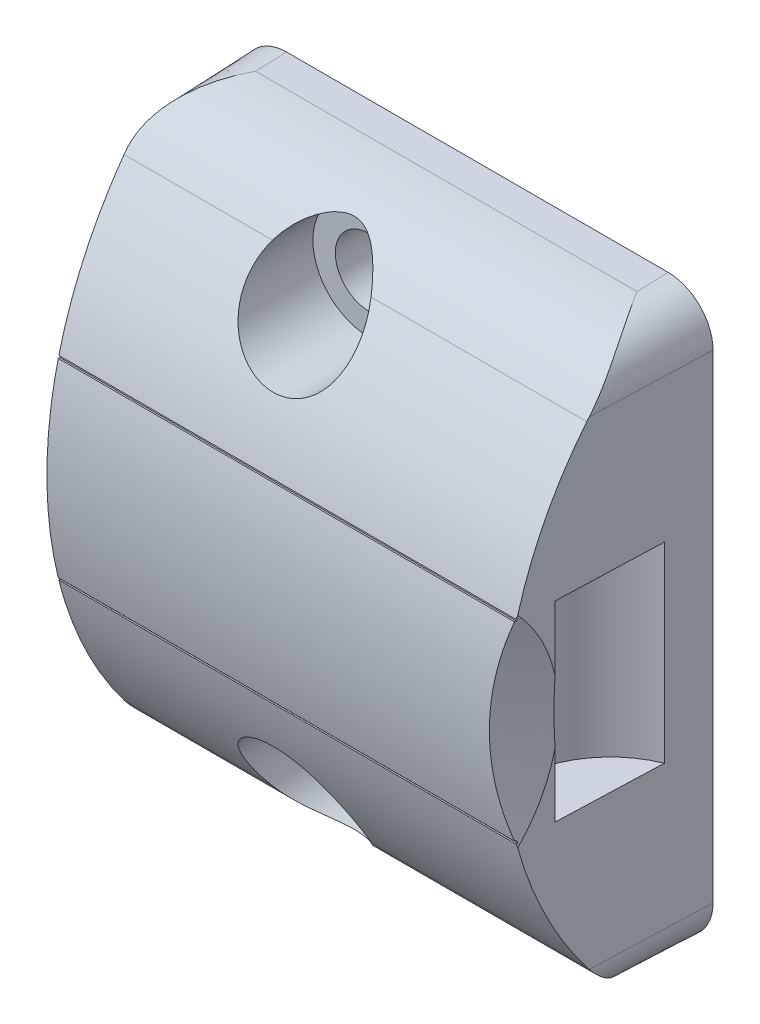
ISO-10303-21;
HEADER;
FILE_DESCRIPTION(('STEP AP214'),'2;1');
FILE_NAME('part.step','',(''),(''),'','','');
FILE_SCHEMA(('AUTOMOTIVE_DESIGN { 1 0 10303 214 1 1 1 1 }'));
ENDSEC;
DATA;
#1=APPLICATION_CONTEXT('core data for automotive mechanical design processes');
#2=APPLICATION_PROTOCOL_DEFINITION('international standard','automotive_design',2000,#1);
#3=PRODUCT_CONTEXT('',#1,'mechanical');
#4=PRODUCT('Part','Part','',(#3));
#5=PRODUCT_RELATED_PRODUCT_CATEGORY('part','',(#4));
#6=PRODUCT_DEFINITION_FORMATION('','',#4);
#7=PRODUCT_DEFINITION_CONTEXT('part definition',#1,'design');
#8=PRODUCT_DEFINITION('design','',#6,#7);
#9=PRODUCT_DEFINITION_SHAPE('','',#8);
#10=(LENGTH_UNIT() NAMED_UNIT(*) SI_UNIT(.MILLI.,.METRE.));
#11=(NAMED_UNIT(*) PLANE_ANGLE_UNIT() SI_UNIT($,.RADIAN.));
#12=(NAMED_UNIT(*) SI_UNIT($,.STERADIAN.) SOLID_ANGLE_UNIT());
#13=UNCERTAINTY_MEASURE_WITH_UNIT(LENGTH_MEASURE(1.E-05),#10,'distance_accuracy_value','');
#14=(GEOMETRIC_REPRESENTATION_CONTEXT(3) GLOBAL_UNCERTAINTY_ASSIGNED_CONTEXT((#13)) GLOBAL_UNIT_ASSIGNED_CONTEXT((#10,
#11,#12)) REPRESENTATION_CONTEXT('',''));
#15=CARTESIAN_POINT('',(0.,0.,0.));
#16=DIRECTION('',(0.,0.,1.));
#17=DIRECTION('',(1.,0.,0.));
#18=AXIS2_PLACEMENT_3D('',#15,#16,#17);
#19=CARTESIAN_POINT('',(-32.0000000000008,13.9999999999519,-12.5000000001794));
#20=DIRECTION('',(-1.,0.,0.));
#21=DIRECTION('',(0.,-1.,0.));
#22=AXIS2_PLACEMENT_3D('',#19,#20,#21);
#23=CYLINDRICAL_SURFACE('',#22,25.9000000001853);
#24=DIRECTION('',(-1.,0.,0.));
#25=VECTOR('',#24,1.);
#26=CARTESIAN_POINT('',(-32.0000000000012,20.4999999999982,12.5710988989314));
#27=LINE('',#26,#25);
#28=CARTESIAN_POINT('',(-13.0610075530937,20.4999999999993,12.5710988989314));
#29=VERTEX_POINT('',#28);
#30=CARTESIAN_POINT('',(17.5187123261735,20.4999999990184,12.5710988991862));
#31=VERTEX_POINT('',#30);
#32=EDGE_CURVE('E191',#29,#31,#27,.F.);
#33=ORIENTED_EDGE('',*,*,#32,.F.);
#34=CARTESIAN_POINT('',(-13.9365096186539,13.9999999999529,-12.5000000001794));
#35=DIRECTION('',(-0.999390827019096,0.,0.034899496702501));
#36=DIRECTION('',(-0.034899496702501,0.,-0.999390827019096));
#37=AXIS2_PLACEMENT_3D('',#34,#35,#36);
#38=ELLIPSE('',#37,25.9157871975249,25.9000000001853);
#39=CARTESIAN_POINT('',(-13.0596662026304,20.3499999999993,12.6095101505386));
#40=VERTEX_POINT('',#39);
#41=EDGE_CURVE('E195',#29,#40,#38,.F.);
#42=ORIENTED_EDGE('',*,*,#41,.T.);
#43=DIRECTION('',(-1.,0.,0.));
#44=VECTOR('',#43,1.);
#45=CARTESIAN_POINT('',(-32.0000000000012,20.3499999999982,12.6095101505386));
#46=LINE('',#45,#44);
#47=CARTESIAN_POINT('',(17.4744020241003,20.34999999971,12.6095101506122));
#48=VERTEX_POINT('',#47);
#49=EDGE_CURVE('E193',#48,#40,#46,.T.);
#50=ORIENTED_EDGE('',*,*,#49,.F.);
#51=CARTESIAN_POINT('',(17.4744020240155,20.3499999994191,12.6095101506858));
#52=CARTESIAN_POINT('',(17.4817021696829,20.375042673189,12.6031769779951));
#53=CARTESIAN_POINT('',(17.4890447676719,20.4000640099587,12.596809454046));
#54=CARTESIAN_POINT('',(17.5038148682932,20.4500640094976,12.5840057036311));
#55=CARTESIAN_POINT('',(17.5112423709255,20.4750426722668,12.5775694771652));
#56=CARTESIAN_POINT('',(17.5187123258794,20.4999999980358,12.5710988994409));
#57=B_SPLINE_CURVE_WITH_KNOTS('',3,(#51,#52,#53,#54,#55,#56),.UNSPECIFIED.,.F.,.F.,(4,2,4),(0.,
0.0805278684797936,0.161055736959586),.UNSPECIFIED.);
#58=EDGE_CURVE('E18',#48,#31,#57,.T.);
#59=ORIENTED_EDGE('',*,*,#58,.T.);
#60=EDGE_LOOP('',(#33,#42,#50,#59));
#61=FACE_BOUND('',#60,.T.);
#62=ADVANCED_FACE('F14',(#61),#23,.T.);
#63=CARTESIAN_POINT('',(-32.0000000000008,14.0000000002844,-12.5000000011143));
#64=DIRECTION('',(-1.,0.,0.));
#65=DIRECTION('',(0.,-1.,0.));
#66=AXIS2_PLACEMENT_3D('',#63,#64,#65);
#67=CYLINDRICAL_SURFACE('',#66,25.9000000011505);
#68=DIRECTION('',(-1.,0.,0.));
#69=VECTOR('',#68,1.);
#70=CARTESIAN_POINT('',(-32.0000000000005,7.64999999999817,12.6095101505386));
#71=LINE('',#70,#69);
#72=CARTESIAN_POINT('',(-13.0596662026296,7.64999999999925,12.6095101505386));
#73=VERTEX_POINT('',#72);
#74=CARTESIAN_POINT('',(17.4744020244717,7.64999999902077,12.6095101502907));
#75=VERTEX_POINT('',#74);
#76=EDGE_CURVE('E281',#73,#75,#71,.F.);
#77=ORIENTED_EDGE('',*,*,#76,.F.);
#78=CARTESIAN_POINT('',(-13.9365096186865,14.0000000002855,-12.5000000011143));
#79=DIRECTION('',(-0.999390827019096,0.,0.034899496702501));
#80=DIRECTION('',(-0.034899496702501,0.,-0.999390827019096));
#81=AXIS2_PLACEMENT_3D('',#78,#79,#80);
#82=ELLIPSE('',#81,25.9157871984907,25.9000000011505);
#83=CARTESIAN_POINT('',(-13.0610075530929,7.49999999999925,12.5710988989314));
#84=VERTEX_POINT('',#83);
#85=EDGE_CURVE('E257',#73,#84,#82,.F.);
#86=ORIENTED_EDGE('',*,*,#85,.T.);
#87=DIRECTION('',(-1.,0.,0.));
#88=VECTOR('',#87,1.);
#89=CARTESIAN_POINT('',(-32.0000000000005,7.49999999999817,12.5710988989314));
#90=LINE('',#89,#88);
#91=CARTESIAN_POINT('',(17.5187123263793,7.50000000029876,12.5710988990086));
#92=VERTEX_POINT('',#91);
#93=EDGE_CURVE('E272',#92,#84,#90,.T.);
#94=ORIENTED_EDGE('',*,*,#93,.F.);
#95=CARTESIAN_POINT('',(17.5187123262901,7.50000000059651,12.5710988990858));
#96=CARTESIAN_POINT('',(17.5112423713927,7.52495732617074,12.577569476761));
#97=CARTESIAN_POINT('',(17.5038148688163,7.54993598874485,12.5840057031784));
#98=CARTESIAN_POINT('',(17.4890447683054,7.59993598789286,12.5968094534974));
#99=CARTESIAN_POINT('',(17.4817021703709,7.62495732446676,12.603176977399));
#100=CARTESIAN_POINT('',(17.4744020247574,7.64999999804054,12.6095101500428));
#101=B_SPLINE_CURVE_WITH_KNOTS('',3,(#95,#96,#97,#98,#99,#100),.UNSPECIFIED.,.F.,.F.,(4,2,4),
(0.,0.0805278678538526,0.161055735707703),.UNSPECIFIED.);
#102=EDGE_CURVE('E251',#92,#75,#101,.T.);
#103=ORIENTED_EDGE('',*,*,#102,.T.);
#104=EDGE_LOOP('',(#77,#86,#94,#103));
#105=FACE_BOUND('',#104,.T.);
#106=ADVANCED_FACE('F245',(#105),#67,.T.);
#107=CARTESIAN_POINT('',(14.5749999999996,7.60000000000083,9.425));
#108=DIRECTION('',(0.,-1.,0.));
#109=DIRECTION('',(0.,0.,1.));
#110=AXIS2_PLACEMENT_3D('',#107,#108,#109);
#111=CYLINDRICAL_SURFACE('',#110,0.775);
#112=DIRECTION('',(0.,-1.,0.));
#113=VECTOR('',#112,1.);
#114=CARTESIAN_POINT('',(14.5749999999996,7.60000000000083,10.2));
#115=LINE('',#114,#113);
#116=CARTESIAN_POINT('',(14.5749999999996,7.60000000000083,10.2));
#117=VERTEX_POINT('',#116);
#118=CARTESIAN_POINT('',(14.5749999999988,20.4000000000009,10.2));
#119=VERTEX_POINT('',#118);
#120=EDGE_CURVE('E285',#117,#119,#115,.F.);
#121=ORIENTED_EDGE('',*,*,#120,.F.);
#122=CARTESIAN_POINT('',(14.5749999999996,7.60000000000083,9.425));
#123=DIRECTION('',(0.,-1.,0.));
#124=DIRECTION('',(0.,0.,1.));
#125=AXIS2_PLACEMENT_3D('',#122,#123,#124);
#126=CIRCLE('',#125,0.775);
#127=CARTESIAN_POINT('',(13.7999999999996,7.60000000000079,9.42500000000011));
#128=VERTEX_POINT('',#127);
#129=EDGE_CURVE('E870',#117,#128,#126,.T.);
#130=ORIENTED_EDGE('',*,*,#129,.T.);
#131=DIRECTION('',(0.,-1.,0.));
#132=VECTOR('',#131,1.);
#133=CARTESIAN_POINT('',(13.7999999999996,7.60000000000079,9.425));
#134=LINE('',#133,#132);
#135=CARTESIAN_POINT('',(13.7999999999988,20.4000000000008,9.42500000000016));
#136=VERTEX_POINT('',#135);
#137=EDGE_CURVE('E289',#128,#136,#134,.F.);
#138=ORIENTED_EDGE('',*,*,#137,.T.);
#139=CARTESIAN_POINT('',(14.5749999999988,20.4000000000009,9.425));
#140=DIRECTION('',(0.,-1.,0.));
#141=DIRECTION('',(0.,0.,1.));
#142=AXIS2_PLACEMENT_3D('',#139,#140,#141);
#143=CIRCLE('',#142,0.775);
#144=EDGE_CURVE('E292',#119,#136,#143,.T.);
#145=ORIENTED_EDGE('',*,*,#144,.F.);
#146=EDGE_LOOP('',(#121,#130,#138,#145));
#147=FACE_BOUND('',#146,.T.);
#148=ADVANCED_FACE('F241',(#147),#111,.F.);
#149=CARTESIAN_POINT('',(-32.0000000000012,20.4999999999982,18.));
#150=DIRECTION('',(0.,-1.,0.));
#151=DIRECTION('',(0.,0.,1.));
#152=AXIS2_PLACEMENT_3D('',#149,#150,#151);
#153=PLANE('',#152);
#154=CARTESIAN_POINT('',(17.518712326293,20.500000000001,12.571098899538));
#155=CARTESIAN_POINT('',(17.5137587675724,20.500000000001,12.588305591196));
#156=CARTESIAN_POINT('',(17.5088205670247,20.500000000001,12.6055166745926));
#157=CARTESIAN_POINT('',(17.4989748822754,20.500000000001,12.6399476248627));
#158=CARTESIAN_POINT('',(17.4940673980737,20.500000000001,12.6571674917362));
#159=CARTESIAN_POINT('',(17.4891752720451,20.500000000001,12.6743917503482));
#160=B_SPLINE_CURVE_WITH_KNOTS('',3,(#154,#155,#156,#157,#158,#159),.UNSPECIFIED.,.F.,.F.,(4,2,
4),(0.,0.0537165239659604,0.107433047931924),.UNSPECIFIED.);
#161=CARTESIAN_POINT('',(17.489175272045,20.500000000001,12.6743917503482));
#162=VERTEX_POINT('',#161);
#163=EDGE_CURVE('E200',#31,#162,#160,.T.);
#164=ORIENTED_EDGE('',*,*,#163,.T.);
#165=DIRECTION('',(-1.,0.,0.));
#166=VECTOR('',#165,1.);
#167=CARTESIAN_POINT('',(-17.0000000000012,20.4999999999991,12.6743917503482));
#168=LINE('',#167,#166);
#169=CARTESIAN_POINT('',(-13.0574004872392,20.4999999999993,12.6743917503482));
#170=VERTEX_POINT('',#169);
#171=EDGE_CURVE('E413',#170,#162,#168,.F.);
#172=ORIENTED_EDGE('',*,*,#171,.F.);
#173=DIRECTION('',(-0.034899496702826,0.,-0.999390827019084));
#174=VECTOR('',#173,1.);
#175=CARTESIAN_POINT('',(-13.0574004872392,20.4999999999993,12.6743917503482));
#176=LINE('',#175,#174);
#177=EDGE_CURVE('E202',#170,#29,#176,.T.);
#178=ORIENTED_EDGE('',*,*,#177,.T.);
#179=ORIENTED_EDGE('',*,*,#32,.T.);
#180=EDGE_LOOP('',(#164,#172,#178,#179));
#181=FACE_BOUND('',#180,.T.);
#182=ADVANCED_FACE('F198',(#181),#153,.T.);
#183=CARTESIAN_POINT('',(-1.60288449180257E-12,28.,20.));
#184=DIRECTION('',(0.,0.,-1.));
#185=DIRECTION('',(0.,-1.,0.));
#186=AXIS2_PLACEMENT_3D('',#183,#184,#185);
#187=CYLINDRICAL_SURFACE('',#186,3.75);
#188=CARTESIAN_POINT('',(-1.60288449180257E-12,28.,5.));
#189=DIRECTION('',(0.,0.,-1.));
#190=DIRECTION('',(0.,-1.,0.));
#191=AXIS2_PLACEMENT_3D('',#188,#189,#190);
#192=CIRCLE('',#191,3.75);
#193=CARTESIAN_POINT('',(-1.38805999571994E-12,24.25,5.));
#194=VERTEX_POINT('',#193);
#195=EDGE_CURVE('E873',#194,#194,#192,.F.);
#196=ORIENTED_EDGE('',*,*,#195,.F.);
#197=EDGE_LOOP('',(#196));
#198=FACE_BOUND('',#197,.T.);
#199=CARTESIAN_POINT('',(3.29463298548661,29.7910593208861,8.1553248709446));
#200=CARTESIAN_POINT('',(3.35768381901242,29.6750414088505,8.24403740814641));
#201=CARTESIAN_POINT('',(3.41442283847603,29.5561039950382,8.33340076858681));
#202=CARTESIAN_POINT('',(3.5150201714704,29.3131850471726,8.51259060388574));
#203=CARTESIAN_POINT('',(3.55887538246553,29.1892023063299,8.60241718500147));
#204=CARTESIAN_POINT('',(3.63360282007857,28.9364170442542,8.78209720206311));
#205=CARTESIAN_POINT('',(3.66440937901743,28.8075936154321,8.8719485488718));
#206=CARTESIAN_POINT('',(3.71232071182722,28.546604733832,9.05043534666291));
#207=CARTESIAN_POINT('',(3.72942670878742,28.4144395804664,9.13907090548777));
#208=CARTESIAN_POINT('',(3.74908350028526,28.1529335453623,9.31096051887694));
#209=CARTESIAN_POINT('',(3.75217483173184,28.0236829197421,9.39428976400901));
#210=CARTESIAN_POINT('',(3.74481934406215,27.7640005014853,9.5584649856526));
#211=CARTESIAN_POINT('',(3.73437437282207,27.633568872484,9.63931129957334));
#212=CARTESIAN_POINT('',(3.69951884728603,27.3728358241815,9.79776899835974));
#213=CARTESIAN_POINT('',(3.67512739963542,27.2425344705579,9.87538465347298));
#214=CARTESIAN_POINT('',(3.6120060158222,26.9832934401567,10.0267973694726));
#215=CARTESIAN_POINT('',(3.57328653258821,26.854352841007,10.1005971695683));
#216=CARTESIAN_POINT('',(3.48534441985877,26.6107158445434,10.2373609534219));
#217=CARTESIAN_POINT('',(3.4373755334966,26.4957792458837,10.3007031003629));
#218=CARTESIAN_POINT('',(3.32923255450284,26.2695623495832,10.4232277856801));
#219=CARTESIAN_POINT('',(3.26906566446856,26.1582799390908,10.4824127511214));
#220=CARTESIAN_POINT('',(3.13659194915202,25.9407521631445,10.5961793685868));
#221=CARTESIAN_POINT('',(3.06428986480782,25.8345048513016,10.6507628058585));
#222=CARTESIAN_POINT('',(2.90779210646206,25.6285097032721,10.7549151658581));
#223=CARTESIAN_POINT('',(2.82359876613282,25.5287605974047,10.8044850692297));
#224=CARTESIAN_POINT('',(2.65713336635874,25.3514786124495,10.891284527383));
#225=CARTESIAN_POINT('',(2.57641904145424,25.2728419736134,10.929254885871));
#226=CARTESIAN_POINT('',(2.4071922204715,25.1223726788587,11.0010589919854));
#227=CARTESIAN_POINT('',(2.31868104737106,25.0505388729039,11.0348934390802));
#228=CARTESIAN_POINT('',(2.13452008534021,24.9146454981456,11.0982231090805));
#229=CARTESIAN_POINT('',(2.03887483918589,24.8505810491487,11.1277210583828));
#230=CARTESIAN_POINT('',(1.8411501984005,24.7310542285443,11.1822463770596));
#231=CARTESIAN_POINT('',(1.73907145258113,24.6755909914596,11.2072741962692));
#232=CARTESIAN_POINT('',(1.54156316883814,24.5799580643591,11.2500927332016));
#233=CARTESIAN_POINT('',(1.44673870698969,24.5387602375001,11.2683864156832));
#234=CARTESIAN_POINT('',(1.25341652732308,24.4641573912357,11.3013250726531));
#235=CARTESIAN_POINT('',(1.15491764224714,24.43075487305,11.3159688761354));
#236=CARTESIAN_POINT('',(0.955111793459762,24.3721779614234,11.3415382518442));
#237=CARTESIAN_POINT('',(0.853806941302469,24.3469975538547,11.3524665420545));
#238=CARTESIAN_POINT('',(0.64908820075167,24.3051247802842,11.3705870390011));
#239=CARTESIAN_POINT('',(0.545673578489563,24.288435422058,11.3777779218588));
#240=CARTESIAN_POINT('',(0.343924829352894,24.2645077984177,11.3880731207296));
#241=CARTESIAN_POINT('',(0.245662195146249,24.2567584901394,11.3913985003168));
#242=CARTESIAN_POINT('',(0.0487390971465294,24.2490218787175,11.3947184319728));
#243=CARTESIAN_POINT('',(-0.0499214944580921,24.249037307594,11.3947118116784));
#244=CARTESIAN_POINT('',(-0.246826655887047,24.2568356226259,11.3913654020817));
#245=CARTESIAN_POINT('',(-0.345071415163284,24.2646144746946,11.3880273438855));
#246=CARTESIAN_POINT('',(-0.54051247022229,24.2878529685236,11.3780284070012));
#247=CARTESIAN_POINT('',(-0.637708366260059,24.303315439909,11.3713663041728));
#248=CARTESIAN_POINT('',(-0.828774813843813,24.341453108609,11.354868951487));
#249=CARTESIAN_POINT('',(-0.922673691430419,24.3640088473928,11.3450862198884));
#250=CARTESIAN_POINT('',(-1.1081122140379,24.4161636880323,11.3223495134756));
#251=CARTESIAN_POINT('',(-1.19965100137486,24.4457653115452,11.3093944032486));
#252=CARTESIAN_POINT('',(-1.46972320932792,24.5447037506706,11.2658255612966));
#253=CARTESIAN_POINT('',(-1.64390861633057,24.6242138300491,11.2304914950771));
#254=CARTESIAN_POINT('',(-1.97934542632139,24.8090481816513,11.1468794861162));
#255=CARTESIAN_POINT('',(-2.14025638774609,24.9148705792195,11.0983498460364));
#256=CARTESIAN_POINT('',(-2.44162469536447,25.1474223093,10.9893898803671));
#257=CARTESIAN_POINT('',(-2.58207808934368,25.2741556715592,10.9289572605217));
#258=CARTESIAN_POINT('',(-2.84751359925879,25.5519047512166,10.793318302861));
#259=CARTESIAN_POINT('',(-2.97113408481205,25.7039000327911,10.7174603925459));
#260=CARTESIAN_POINT('',(-3.19119282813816,26.0210880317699,10.5548308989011));
#261=CARTESIAN_POINT('',(-3.28762217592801,26.186285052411,10.4680557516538));
#262=CARTESIAN_POINT('',(-3.46093842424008,26.5415191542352,10.2761901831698));
#263=CARTESIAN_POINT('',(-3.53500737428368,26.732408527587,10.1701390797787));
#264=CARTESIAN_POINT('',(-3.65053405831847,27.118639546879,9.94885152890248));
#265=CARTESIAN_POINT('',(-3.69197496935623,27.3139834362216,9.83361037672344));
#266=CARTESIAN_POINT('',(-3.74685913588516,27.7297764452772,9.58075560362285));
#267=CARTESIAN_POINT('',(-3.75598838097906,27.9502051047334,9.4421760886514));
#268=CARTESIAN_POINT('',(-3.73648952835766,28.3856145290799,9.15921523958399));
#269=CARTESIAN_POINT('',(-3.70784350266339,28.6005926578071,9.01483118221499));
#270=CARTESIAN_POINT('',(-3.6233754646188,28.9820649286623,8.75044165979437));
#271=CARTESIAN_POINT('',(-3.57353653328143,29.1501913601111,8.63084861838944));
#272=CARTESIAN_POINT('',(-3.48164223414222,29.3958116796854,8.45183152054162));
#273=CARTESIAN_POINT('',(-3.44819698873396,29.4765124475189,8.39228086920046));
#274=CARTESIAN_POINT('',(-3.37564653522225,29.6355864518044,8.27350007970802));
#275=CARTESIAN_POINT('',(-3.33654071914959,29.7139594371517,8.21426997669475));
#276=CARTESIAN_POINT('',(-3.29463298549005,29.7910593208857,8.15532487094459));
#277=B_SPLINE_CURVE_WITH_KNOTS('',3,(#199,#200,#201,#202,#203,#204,#205,#206,#207,#208,#209,
#210,#211,#212,#213,#214,#215,#216,#217,#218,#219,#220,#221,#222,#223,#224,#225,#226,#227,#228,
#229,#230,#231,#232,#233,#234,#235,#236,#237,#238,#239,#240,#241,#242,#243,#244,#245,#246,#247,
#248,#249,#250,#251,#252,#253,#254,#255,#256,#257,#258,#259,#260,#261,#262,#263,#264,#265,#266,
#267,#268,#269,#270,#271,#272,#273,#274,#275,#276),.UNSPECIFIED.,.F.,.F.,(4,2,2,2,2,2,2,2,2,2,2,
2,2,2,2,2,2,2,2,2,2,2,2,2,2,2,2,2,2,2,2,2,2,2,2,2,2,2,4),(0.,0.477065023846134,
0.954244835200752,1.43379832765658,1.91330900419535,2.3741585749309,2.83494524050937,
3.29510213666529,3.7549239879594,4.17349796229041,4.59182549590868,5.00998997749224,
5.42807250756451,5.78431676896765,6.14050069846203,6.49645972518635,6.85238291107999,
7.16696029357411,7.48163847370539,7.79608596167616,8.11064475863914,8.40615839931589,
8.70177601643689,8.99724010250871,9.29281307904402,9.58365318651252,9.87459753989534,
10.4558911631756,11.0491618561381,11.6425470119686,12.270195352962,12.8980491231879,
13.5870511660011,14.2764082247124,15.0549184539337,15.8337982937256,16.4690987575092,
16.7861126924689,17.1031607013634),.UNSPECIFIED.);
#278=CARTESIAN_POINT('',(3.29463298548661,29.7910593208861,8.1553248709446));
#279=VERTEX_POINT('',#278);
#280=CARTESIAN_POINT('',(-3.29463298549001,29.7910593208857,8.1553248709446));
#281=VERTEX_POINT('',#280);
#282=EDGE_CURVE('E389',#279,#281,#277,.T.);
#283=ORIENTED_EDGE('',*,*,#282,.F.);
#284=CARTESIAN_POINT('',(-3.29463298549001,29.7910593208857,8.15532487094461));
#285=CARTESIAN_POINT('',(-3.23169624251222,29.9067436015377,8.06690922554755));
#286=CARTESIAN_POINT('',(-3.16332381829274,30.0180764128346,7.97676718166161));
#287=CARTESIAN_POINT('',(-3.01630014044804,30.2318939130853,7.79431075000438));
#288=CARTESIAN_POINT('',(-2.93764619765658,30.3343762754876,7.70199579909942));
#289=CARTESIAN_POINT('',(-2.76985998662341,30.5312556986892,7.51560450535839));
#290=CARTESIAN_POINT('',(-2.68063177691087,30.6255627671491,7.42151977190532));
#291=CARTESIAN_POINT('',(-2.49253522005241,30.8047542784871,7.2340590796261));
#292=CARTESIAN_POINT('',(-2.39366993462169,30.8896416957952,7.1406829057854));
#293=CARTESIAN_POINT('',(-2.21882912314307,31.0244572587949,6.98561554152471));
#294=CARTESIAN_POINT('',(-2.14546160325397,31.0769706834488,6.92321460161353));
#295=CARTESIAN_POINT('',(-1.99393117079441,31.1772620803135,6.80047726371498));
#296=CARTESIAN_POINT('',(-1.91576936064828,31.2250411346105,6.74014039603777));
#297=CARTESIAN_POINT('',(-1.75459240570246,31.3154821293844,6.62271291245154));
#298=CARTESIAN_POINT('',(-1.67159134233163,31.3581579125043,6.56561374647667));
#299=CARTESIAN_POINT('',(-1.5002615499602,31.4381167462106,6.455867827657));
#300=CARTESIAN_POINT('',(-1.41193542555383,31.4754024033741,6.40321892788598));
#301=CARTESIAN_POINT('',(-1.20606256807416,31.5528777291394,6.29131045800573));
#302=CARTESIAN_POINT('',(-1.08685264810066,31.591338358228,6.23384531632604));
#303=CARTESIAN_POINT('',(-0.839532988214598,31.6570434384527,6.13355316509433));
#304=CARTESIAN_POINT('',(-0.711441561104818,31.6843102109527,6.09069705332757));
#305=CARTESIAN_POINT('',(-0.47003233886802,31.7220804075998,6.03062744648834));
#306=CARTESIAN_POINT('',(-0.35782480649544,31.7346242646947,6.01032478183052));
#307=CARTESIAN_POINT('',(-0.130982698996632,31.7494299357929,5.98631555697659));
#308=CARTESIAN_POINT('',(-0.0163501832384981,31.751700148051,5.98259544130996));
#309=CARTESIAN_POINT('',(0.211852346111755,31.7457513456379,5.99227615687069));
#310=CARTESIAN_POINT('',(0.325422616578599,31.7375349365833,6.00567273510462));
#311=CARTESIAN_POINT('',(0.548537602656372,31.7113705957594,6.04771194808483));
#312=CARTESIAN_POINT('',(0.658077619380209,31.693411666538,6.0763718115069));
#313=CARTESIAN_POINT('',(0.920501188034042,31.6387515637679,6.16180123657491));
#314=CARTESIAN_POINT('',(1.07010252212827,31.5972274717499,6.22543807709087));
#315=CARTESIAN_POINT('',(1.35613703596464,31.4994874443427,6.36922134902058));
#316=CARTESIAN_POINT('',(1.49252097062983,31.4432192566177,6.44942627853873));
#317=CARTESIAN_POINT('',(1.73008642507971,31.3291843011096,6.60474917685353));
#318=CARTESIAN_POINT('',(1.83326180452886,31.2733856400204,6.67831990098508));
#319=CARTESIAN_POINT('',(2.03179588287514,31.1540033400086,6.82968637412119));
#320=CARTESIAN_POINT('',(2.12714932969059,31.0904145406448,6.90748490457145));
#321=CARTESIAN_POINT('',(2.31044825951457,30.9558841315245,7.06547121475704));
#322=CARTESIAN_POINT('',(2.39839105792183,30.8849398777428,7.14565984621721));
#323=CARTESIAN_POINT('',(2.56699534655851,30.7359975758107,7.3070021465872));
#324=CARTESIAN_POINT('',(2.64765947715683,30.658002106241,7.38815545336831));
#325=CARTESIAN_POINT('',(2.83542627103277,30.4594358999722,7.58583228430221));
#326=CARTESIAN_POINT('',(2.93869524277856,30.3351446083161,7.70232855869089));
#327=CARTESIAN_POINT('',(3.08150716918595,30.1385350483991,7.87457461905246));
#328=CARTESIAN_POINT('',(3.12701540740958,30.0714500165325,7.93146023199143));
#329=CARTESIAN_POINT('',(3.21394010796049,29.9338318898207,8.04422246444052));
#330=CARTESIAN_POINT('',(3.25535544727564,29.863297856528,8.1000988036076));
#331=CARTESIAN_POINT('',(3.29463298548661,29.7910593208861,8.15532487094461));
#332=B_SPLINE_CURVE_WITH_KNOTS('',3,(#284,#285,#286,#287,#288,#289,#290,#291,#292,#293,#294,
#295,#296,#297,#298,#299,#300,#301,#302,#303,#304,#305,#306,#307,#308,#309,#310,#311,#312,#313,
#314,#315,#316,#317,#318,#319,#320,#321,#322,#323,#324,#325,#326,#327,#328,#329,#330,#331),
.UNSPECIFIED.,.F.,.F.,(4,2,2,2,2,2,2,2,2,2,2,2,2,2,2,2,2,2,2,2,2,2,2,4),(0.,0.475628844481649,
0.951382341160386,1.4318412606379,1.91214803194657,2.24105614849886,2.56988891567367,
2.89780845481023,3.22556888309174,3.63781907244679,4.04924316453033,4.39188432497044,
4.73424534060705,5.07652130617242,5.4191844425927,5.9197203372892,6.42205467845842,
6.83689285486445,7.25200733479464,7.66727155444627,8.08238452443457,8.67874141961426,
8.97571248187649,9.2727648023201),.UNSPECIFIED.);
#333=EDGE_CURVE('E209',#281,#279,#332,.T.);
#334=ORIENTED_EDGE('',*,*,#333,.F.);
#335=EDGE_LOOP('',(#283,#334));
#336=FACE_BOUND('',#335,.T.);
#337=ADVANCED_FACE('F240',(#198,#336),#187,.F.);
#338=CARTESIAN_POINT('',(-32.0000000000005,7.49999999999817,12.5710988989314));
#339=DIRECTION('',(0.,1.,0.));
#340=DIRECTION('',(0.,0.,-1.));
#341=AXIS2_PLACEMENT_3D('',#338,#339,#340);
#342=PLANE('',#341);
#343=CARTESIAN_POINT('',(17.4891752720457,7.500000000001,12.6743917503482));
#344=CARTESIAN_POINT('',(17.4940673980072,7.500000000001,12.657167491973));
#345=CARTESIAN_POINT('',(17.4989748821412,7.50000000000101,12.6399476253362));
#346=CARTESIAN_POINT('',(17.5088205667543,7.50000000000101,12.6055166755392));
#347=CARTESIAN_POINT('',(17.5137587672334,7.500000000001,12.5883055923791));
#348=CARTESIAN_POINT('',(17.5187123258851,7.500000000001,12.5710989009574));
#349=B_SPLINE_CURVE_WITH_KNOTS('',3,(#343,#344,#345,#346,#347,#348),.UNSPECIFIED.,.F.,.F.,(4,2,
4),(0.,0.0537165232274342,0.107433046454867),.UNSPECIFIED.);
#350=CARTESIAN_POINT('',(17.4891752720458,7.50000000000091,12.6743917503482));
#351=VERTEX_POINT('',#350);
#352=EDGE_CURVE('E454',#351,#92,#349,.T.);
#353=ORIENTED_EDGE('',*,*,#352,.T.);
#354=ORIENTED_EDGE('',*,*,#93,.T.);
#355=DIRECTION('',(0.034899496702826,0.,0.999390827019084));
#356=VECTOR('',#355,1.);
#357=CARTESIAN_POINT('',(-13.0610075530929,7.49999999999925,12.5710988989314));
#358=LINE('',#357,#356);
#359=CARTESIAN_POINT('',(-13.0574004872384,7.49999999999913,12.6743917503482));
#360=VERTEX_POINT('',#359);
#361=EDGE_CURVE('E204',#84,#360,#358,.T.);
#362=ORIENTED_EDGE('',*,*,#361,.T.);
#363=DIRECTION('',(-1.,0.,0.));
#364=VECTOR('',#363,1.);
#365=CARTESIAN_POINT('',(-17.0000000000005,7.49999999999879,12.6743917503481));
#366=LINE('',#365,#364);
#367=EDGE_CURVE('E384',#351,#360,#366,.T.);
#368=ORIENTED_EDGE('',*,*,#367,.F.);
#369=EDGE_LOOP('',(#353,#354,#362,#368));
#370=FACE_BOUND('',#369,.T.);
#371=ADVANCED_FACE('F658',(#370),#342,.T.);
#372=CARTESIAN_POINT('',(-32.0000000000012,20.3499999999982,12.6095101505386));
#373=DIRECTION('',(0.,1.,0.));
#374=DIRECTION('',(0.,0.,-1.));
#375=AXIS2_PLACEMENT_3D('',#372,#373,#374);
#376=PLANE('',#375);
#377=CARTESIAN_POINT('',(17.4450913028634,20.350000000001,12.7126456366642));
#378=CARTESIAN_POINT('',(17.4499458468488,20.350000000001,12.6954476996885));
#379=CARTESIAN_POINT('',(17.4548156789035,20.350000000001,12.6782541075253));
#380=CARTESIAN_POINT('',(17.4645859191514,20.350000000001,12.6438756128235));
#381=CARTESIAN_POINT('',(17.4694863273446,20.350000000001,12.626690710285));
#382=CARTESIAN_POINT('',(17.4744020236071,20.350000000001,12.6095101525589));
#383=B_SPLINE_CURVE_WITH_KNOTS('',3,(#377,#378,#379,#380,#381,#382),.UNSPECIFIED.,.F.,.F.,(4,2,
4),(0.,0.0536098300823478,0.107219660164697),.UNSPECIFIED.);
#384=CARTESIAN_POINT('',(17.4450913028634,20.350000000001,12.7126456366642));
#385=VERTEX_POINT('',#384);
#386=EDGE_CURVE('E210',#385,#48,#383,.T.);
#387=ORIENTED_EDGE('',*,*,#386,.T.);
#388=ORIENTED_EDGE('',*,*,#49,.T.);
#389=DIRECTION('',(0.0348994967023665,0.,0.999390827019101));
#390=VECTOR('',#389,1.);
#391=CARTESIAN_POINT('',(-13.0596662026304,20.3499999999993,12.6095101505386));
#392=LINE('',#391,#390);
#393=CARTESIAN_POINT('',(-13.056064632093,20.3499999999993,12.7126456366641));
#394=VERTEX_POINT('',#393);
#395=EDGE_CURVE('E264',#40,#394,#392,.T.);
#396=ORIENTED_EDGE('',*,*,#395,.T.);
#397=DIRECTION('',(-1.,0.,0.));
#398=VECTOR('',#397,1.);
#399=CARTESIAN_POINT('',(-17.0000000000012,20.349999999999,12.7126456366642));
#400=LINE('',#399,#398);
#401=EDGE_CURVE('E532',#385,#394,#400,.T.);
#402=ORIENTED_EDGE('',*,*,#401,.F.);
#403=EDGE_LOOP('',(#387,#388,#396,#402));
#404=FACE_BOUND('',#403,.T.);
#405=ADVANCED_FACE('F262',(#404),#376,.T.);
#406=CARTESIAN_POINT('',(-32.0000000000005,7.64999999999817,17.));
#407=DIRECTION('',(0.,-1.,0.));
#408=DIRECTION('',(0.,0.,1.));
#409=AXIS2_PLACEMENT_3D('',#406,#407,#408);
#410=PLANE('',#409);
#411=CARTESIAN_POINT('',(17.4744020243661,7.650000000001,12.6095101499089));
#412=CARTESIAN_POINT('',(17.4694863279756,7.650000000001,12.6266907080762));
#413=CARTESIAN_POINT('',(17.4645859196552,7.650000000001,12.6438756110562));
#414=CARTESIAN_POINT('',(17.4548156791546,7.650000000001,12.6782541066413));
#415=CARTESIAN_POINT('',(17.4499458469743,7.650000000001,12.6954476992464));
#416=CARTESIAN_POINT('',(17.445091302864,7.650000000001,12.7126456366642));
#417=B_SPLINE_CURVE_WITH_KNOTS('',3,(#411,#412,#413,#414,#415,#416),.UNSPECIFIED.,.F.,.F.,(4,2,
4),(0.,0.0536098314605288,0.10721966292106),.UNSPECIFIED.);
#418=CARTESIAN_POINT('',(17.445091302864,7.650000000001,12.7126456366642));
#419=VERTEX_POINT('',#418);
#420=EDGE_CURVE('E214',#75,#419,#417,.T.);
#421=ORIENTED_EDGE('',*,*,#420,.T.);
#422=DIRECTION('',(-1.,0.,0.));
#423=VECTOR('',#422,1.);
#424=CARTESIAN_POINT('',(-17.0000000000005,7.64999999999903,12.7126456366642));
#425=LINE('',#424,#423);
#426=CARTESIAN_POINT('',(-13.0560646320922,7.64999999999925,12.7126456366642));
#427=VERTEX_POINT('',#426);
#428=EDGE_CURVE('E530',#427,#419,#425,.F.);
#429=ORIENTED_EDGE('',*,*,#428,.F.);
#430=DIRECTION('',(-0.0348994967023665,0.,-0.999390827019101));
#431=VECTOR('',#430,1.);
#432=CARTESIAN_POINT('',(-13.0560646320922,7.64999999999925,12.7126456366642));
#433=LINE('',#432,#431);
#434=EDGE_CURVE('E266',#427,#73,#433,.T.);
#435=ORIENTED_EDGE('',*,*,#434,.T.);
#436=ORIENTED_EDGE('',*,*,#76,.T.);
#437=EDGE_LOOP('',(#421,#429,#435,#436));
#438=FACE_BOUND('',#437,.T.);
#439=ADVANCED_FACE('F371',(#438),#410,.T.);
#440=CARTESIAN_POINT('',(0.,0.,20.));
#441=DIRECTION('',(0.,0.,-1.));
#442=DIRECTION('',(0.,-1.,0.));
#443=AXIS2_PLACEMENT_3D('',#440,#441,#442);
#444=CYLINDRICAL_SURFACE('',#443,3.75);
#445=CARTESIAN_POINT('',(0.,0.,5.));
#446=DIRECTION('',(0.,0.,-1.));
#447=DIRECTION('',(0.,-1.,0.));
#448=AXIS2_PLACEMENT_3D('',#445,#446,#447);
#449=CIRCLE('',#448,3.75);
#450=CARTESIAN_POINT('',(2.14824496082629E-13,-3.75,5.));
#451=VERTEX_POINT('',#450);
#452=EDGE_CURVE('E283',#451,#451,#449,.F.);
#453=ORIENTED_EDGE('',*,*,#452,.F.);
#454=EDGE_LOOP('',(#453));
#455=FACE_BOUND('',#454,.T.);
#456=CARTESIAN_POINT('',(3.29463298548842,-1.79105932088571,8.15532487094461));
#457=CARTESIAN_POINT('',(3.23169624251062,-1.90674360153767,8.06690922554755));
#458=CARTESIAN_POINT('',(3.16332381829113,-2.01807641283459,7.97676718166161));
#459=CARTESIAN_POINT('',(3.01630014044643,-2.23189391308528,7.79431075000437));
#460=CARTESIAN_POINT('',(2.93764619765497,-2.33437627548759,7.7019957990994));
#461=CARTESIAN_POINT('',(2.76985998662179,-2.5312556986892,7.51560450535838));
#462=CARTESIAN_POINT('',(2.68063177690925,-2.6255627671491,7.42151977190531));
#463=CARTESIAN_POINT('',(2.4925352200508,-2.80475427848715,7.23405907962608));
#464=CARTESIAN_POINT('',(2.39366993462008,-2.88964169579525,7.14068290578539));
#465=CARTESIAN_POINT('',(2.21882912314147,-3.02445725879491,6.9856155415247));
#466=CARTESIAN_POINT('',(2.14546160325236,-3.0769706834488,6.92321460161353));
#467=CARTESIAN_POINT('',(1.99393117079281,-3.17726208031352,6.80047726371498));
#468=CARTESIAN_POINT('',(1.91576936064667,-3.22504113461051,6.74014039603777));
#469=CARTESIAN_POINT('',(1.75459240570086,-3.3154821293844,6.62271291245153));
#470=CARTESIAN_POINT('',(1.67159134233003,-3.35815791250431,6.56561374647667));
#471=CARTESIAN_POINT('',(1.5002615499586,-3.43811674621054,6.45586782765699));
#472=CARTESIAN_POINT('',(1.41193542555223,-3.47540240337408,6.40321892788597));
#473=CARTESIAN_POINT('',(1.20606256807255,-3.55287772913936,6.29131045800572));
#474=CARTESIAN_POINT('',(1.08685264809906,-3.59133835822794,6.23384531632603));
#475=CARTESIAN_POINT('',(0.839532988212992,-3.65704343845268,6.13355316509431));
#476=CARTESIAN_POINT('',(0.711441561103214,-3.68431021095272,6.09069705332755));
#477=CARTESIAN_POINT('',(0.470032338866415,-3.72208040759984,6.03062744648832));
#478=CARTESIAN_POINT('',(0.357824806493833,-3.73462426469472,6.01032478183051));
#479=CARTESIAN_POINT('',(0.130982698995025,-3.74942993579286,5.98631555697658));
#480=CARTESIAN_POINT('',(0.0163501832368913,-3.75170014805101,5.98259544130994));
#481=CARTESIAN_POINT('',(-0.211852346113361,-3.74575134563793,5.99227615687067));
#482=CARTESIAN_POINT('',(-0.325422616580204,-3.73753493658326,6.00567273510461));
#483=CARTESIAN_POINT('',(-0.548537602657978,-3.71137059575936,6.04771194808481));
#484=CARTESIAN_POINT('',(-0.658077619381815,-3.69341166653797,6.07637181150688));
#485=CARTESIAN_POINT('',(-0.920501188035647,-3.63875156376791,6.16180123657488));
#486=CARTESIAN_POINT('',(-1.07010252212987,-3.59722747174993,6.22543807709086));
#487=CARTESIAN_POINT('',(-1.35613703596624,-3.4994874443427,6.36922134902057));
#488=CARTESIAN_POINT('',(-1.49252097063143,-3.44321925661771,6.4494262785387));
#489=CARTESIAN_POINT('',(-1.73008642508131,-3.32918430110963,6.60474917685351));
#490=CARTESIAN_POINT('',(-1.83326180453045,-3.27338564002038,6.67831990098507));
#491=CARTESIAN_POINT('',(-2.03179588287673,-3.15400334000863,6.82968637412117));
#492=CARTESIAN_POINT('',(-2.12714932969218,-3.09041454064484,6.90748490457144));
#493=CARTESIAN_POINT('',(-2.31044825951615,-2.95588413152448,7.06547121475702));
#494=CARTESIAN_POINT('',(-2.39839105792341,-2.88493987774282,7.14565984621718));
#495=CARTESIAN_POINT('',(-2.56699534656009,-2.73599757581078,7.30700214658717));
#496=CARTESIAN_POINT('',(-2.64765947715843,-2.65800210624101,7.38815545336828));
#497=CARTESIAN_POINT('',(-2.83542627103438,-2.45943589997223,7.58583228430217));
#498=CARTESIAN_POINT('',(-2.93869524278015,-2.33514460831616,7.70232855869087));
#499=CARTESIAN_POINT('',(-3.08150716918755,-2.13853504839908,7.87457461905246));
#500=CARTESIAN_POINT('',(-3.12701540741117,-2.07145001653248,7.93146023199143));
#501=CARTESIAN_POINT('',(-3.21394010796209,-1.9338318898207,8.04422246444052));
#502=CARTESIAN_POINT('',(-3.25535544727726,-1.86329785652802,8.1000988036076));
#503=CARTESIAN_POINT('',(-3.29463298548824,-1.79105932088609,8.15532487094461));
#504=B_SPLINE_CURVE_WITH_KNOTS('',3,(#456,#457,#458,#459,#460,#461,#462,#463,#464,#465,#466,
#467,#468,#469,#470,#471,#472,#473,#474,#475,#476,#477,#478,#479,#480,#481,#482,#483,#484,#485,
#486,#487,#488,#489,#490,#491,#492,#493,#494,#495,#496,#497,#498,#499,#500,#501,#502,#503),
.UNSPECIFIED.,.F.,.F.,(4,2,2,2,2,2,2,2,2,2,2,2,2,2,2,2,2,2,2,2,2,2,2,4),(0.,0.475628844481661,
0.951382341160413,1.43184126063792,1.91214803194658,2.24105614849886,2.56988891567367,
2.89780845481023,3.22556888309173,3.6378190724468,4.04924316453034,4.39188432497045,
4.73424534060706,5.07652130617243,5.41918444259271,5.91972033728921,6.42205467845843,
6.83689285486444,7.25200733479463,7.66727155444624,8.08238452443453,8.67874141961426,
8.97571248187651,9.27276480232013),.UNSPECIFIED.);
#505=CARTESIAN_POINT('',(3.29463298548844,-1.79105932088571,8.15532487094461));
#506=VERTEX_POINT('',#505);
#507=CARTESIAN_POINT('',(-3.29463298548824,-1.79105932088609,8.15532487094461));
#508=VERTEX_POINT('',#507);
#509=EDGE_CURVE('E349',#506,#508,#504,.T.);
#510=ORIENTED_EDGE('',*,*,#509,.F.);
#511=CARTESIAN_POINT('',(-3.29463298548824,-1.79105932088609,8.15532487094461));
#512=CARTESIAN_POINT('',(-3.35768381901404,-1.67504140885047,8.24403740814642));
#513=CARTESIAN_POINT('',(-3.41442283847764,-1.55610399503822,8.33340076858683));
#514=CARTESIAN_POINT('',(-3.515020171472,-1.31318504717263,8.51259060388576));
#515=CARTESIAN_POINT('',(-3.55887538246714,-1.18920230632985,8.60241718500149));
#516=CARTESIAN_POINT('',(-3.63360282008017,-0.936417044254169,8.78209720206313));
#517=CARTESIAN_POINT('',(-3.66440937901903,-0.807593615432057,8.87194854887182));
#518=CARTESIAN_POINT('',(-3.71232071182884,-0.546604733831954,9.05043534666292));
#519=CARTESIAN_POINT('',(-3.72942670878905,-0.414439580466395,9.13907090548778));
#520=CARTESIAN_POINT('',(-3.74908350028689,-0.152933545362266,9.31096051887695));
#521=CARTESIAN_POINT('',(-3.75217483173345,-0.023682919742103,9.39428976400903));
#522=CARTESIAN_POINT('',(-3.74481934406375,0.235999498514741,9.55846498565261));
#523=CARTESIAN_POINT('',(-3.73437437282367,0.366431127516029,9.63931129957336));
#524=CARTESIAN_POINT('',(-3.69951884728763,0.627164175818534,9.79776899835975));
#525=CARTESIAN_POINT('',(-3.67512739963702,0.757465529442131,9.875384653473));
#526=CARTESIAN_POINT('',(-3.6120060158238,1.01670655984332,10.0267973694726));
#527=CARTESIAN_POINT('',(-3.57328653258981,1.14564715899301,10.1005971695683));
#528=CARTESIAN_POINT('',(-3.48534441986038,1.38928415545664,10.2373609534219));
#529=CARTESIAN_POINT('',(-3.4373755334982,1.50422075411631,10.3007031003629));
#530=CARTESIAN_POINT('',(-3.32923255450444,1.73043765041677,10.4232277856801));
#531=CARTESIAN_POINT('',(-3.26906566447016,1.84172006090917,10.4824127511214));
#532=CARTESIAN_POINT('',(-3.13659194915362,2.05924783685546,10.5961793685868));
#533=CARTESIAN_POINT('',(-3.06428986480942,2.16549514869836,10.6507628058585));
#534=CARTESIAN_POINT('',(-2.90779210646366,2.37149029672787,10.7549151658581));
#535=CARTESIAN_POINT('',(-2.82359876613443,2.47123940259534,10.8044850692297));
#536=CARTESIAN_POINT('',(-2.65713336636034,2.64852138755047,10.891284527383));
#537=CARTESIAN_POINT('',(-2.57641904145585,2.72715802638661,10.929254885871));
#538=CARTESIAN_POINT('',(-2.4071922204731,2.87762732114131,11.0010589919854));
#539=CARTESIAN_POINT('',(-2.31868104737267,2.94946112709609,11.0348934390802));
#540=CARTESIAN_POINT('',(-2.13452008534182,3.08535450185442,11.0982231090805));
#541=CARTESIAN_POINT('',(-2.0388748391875,3.14941895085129,11.1277210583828));
#542=CARTESIAN_POINT('',(-1.8411501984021,3.26894577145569,11.1822463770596));
#543=CARTESIAN_POINT('',(-1.73907145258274,3.32440900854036,11.2072741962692));
#544=CARTESIAN_POINT('',(-1.54156316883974,3.42004193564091,11.2500927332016));
#545=CARTESIAN_POINT('',(-1.44673870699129,3.46123976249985,11.2683864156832));
#546=CARTESIAN_POINT('',(-1.25341652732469,3.53584260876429,11.3013250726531));
#547=CARTESIAN_POINT('',(-1.15491764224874,3.56924512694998,11.3159688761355));
#548=CARTESIAN_POINT('',(-0.955111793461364,3.62782203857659,11.3415382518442));
#549=CARTESIAN_POINT('',(-0.85380694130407,3.6530024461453,11.3524665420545));
#550=CARTESIAN_POINT('',(-0.649088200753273,3.69487521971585,11.3705870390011));
#551=CARTESIAN_POINT('',(-0.545673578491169,3.71156457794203,11.3777779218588));
#552=CARTESIAN_POINT('',(-0.343924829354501,3.73549220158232,11.3880731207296));
#553=CARTESIAN_POINT('',(-0.245662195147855,3.74324150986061,11.3913985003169));
#554=CARTESIAN_POINT('',(-0.0487390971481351,3.75097812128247,11.3947184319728));
#555=CARTESIAN_POINT('',(0.0499214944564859,3.75096269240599,11.3947118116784));
#556=CARTESIAN_POINT('',(0.24682665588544,3.74316437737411,11.3913654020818));
#557=CARTESIAN_POINT('',(0.345071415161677,3.73538552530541,11.3880273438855));
#558=CARTESIAN_POINT('',(0.540512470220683,3.71214703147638,11.3780284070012));
#559=CARTESIAN_POINT('',(0.637708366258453,3.69668456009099,11.3713663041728));
#560=CARTESIAN_POINT('',(0.828774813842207,3.65854689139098,11.354868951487));
#561=CARTESIAN_POINT('',(0.922673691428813,3.63599115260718,11.3450862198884));
#562=CARTESIAN_POINT('',(1.10811221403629,3.58383631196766,11.3223495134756));
#563=CARTESIAN_POINT('',(1.19965100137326,3.55423468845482,11.3093944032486));
#564=CARTESIAN_POINT('',(1.46972320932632,3.45529624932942,11.2658255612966));
#565=CARTESIAN_POINT('',(1.64390861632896,3.37578616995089,11.2304914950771));
#566=CARTESIAN_POINT('',(1.97934542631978,3.19095181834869,11.1468794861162));
#567=CARTESIAN_POINT('',(2.14025638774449,3.08512942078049,11.0983498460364));
#568=CARTESIAN_POINT('',(2.44162469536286,2.8525776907,10.9893898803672));
#569=CARTESIAN_POINT('',(2.58207808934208,2.72584432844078,10.9289572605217));
#570=CARTESIAN_POINT('',(2.84751359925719,2.4480952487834,10.793318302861));
#571=CARTESIAN_POINT('',(2.97113408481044,2.2960999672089,10.7174603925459));
#572=CARTESIAN_POINT('',(3.19119282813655,1.97891196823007,10.5548308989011));
#573=CARTESIAN_POINT('',(3.28762217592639,1.81371494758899,10.4680557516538));
#574=CARTESIAN_POINT('',(3.46093842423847,1.45848084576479,10.2761901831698));
#575=CARTESIAN_POINT('',(3.53500737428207,1.26759147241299,10.1701390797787));
#576=CARTESIAN_POINT('',(3.65053405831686,0.881360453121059,9.94885152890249));
#577=CARTESIAN_POINT('',(3.69197496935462,0.686016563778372,9.83361037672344));
#578=CARTESIAN_POINT('',(3.74685913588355,0.270223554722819,9.58075560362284));
#579=CARTESIAN_POINT('',(3.75598838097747,0.0497948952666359,9.4421760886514));
#580=CARTESIAN_POINT('',(3.73648952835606,-0.385614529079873,9.15921523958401));
#581=CARTESIAN_POINT('',(3.70784350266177,-0.600592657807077,9.01483118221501));
#582=CARTESIAN_POINT('',(3.62337546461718,-0.982064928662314,8.75044165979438));
#583=CARTESIAN_POINT('',(3.57353653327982,-1.1501913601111,8.63084861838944));
#584=CARTESIAN_POINT('',(3.48164223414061,-1.39581167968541,8.45183152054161));
#585=CARTESIAN_POINT('',(3.44819698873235,-1.47651244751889,8.39228086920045));
#586=CARTESIAN_POINT('',(3.37564653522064,-1.63558645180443,8.27350007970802));
#587=CARTESIAN_POINT('',(3.33654071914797,-1.71395943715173,8.21426997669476));
#588=CARTESIAN_POINT('',(3.29463298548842,-1.79105932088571,8.1553248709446));
#589=B_SPLINE_CURVE_WITH_KNOTS('',3,(#511,#512,#513,#514,#515,#516,#517,#518,#519,#520,#521,
#522,#523,#524,#525,#526,#527,#528,#529,#530,#531,#532,#533,#534,#535,#536,#537,#538,#539,#540,
#541,#542,#543,#544,#545,#546,#547,#548,#549,#550,#551,#552,#553,#554,#555,#556,#557,#558,#559,
#560,#561,#562,#563,#564,#565,#566,#567,#568,#569,#570,#571,#572,#573,#574,#575,#576,#577,#578,
#579,#580,#581,#582,#583,#584,#585,#586,#587,#588),.UNSPECIFIED.,.F.,.F.,(4,2,2,2,2,2,2,2,2,2,2,
2,2,2,2,2,2,2,2,2,2,2,2,2,2,2,2,2,2,2,2,2,2,2,2,2,2,2,4),(0.,0.477065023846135,
0.954244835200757,1.43379832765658,1.91330900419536,2.37415857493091,2.83494524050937,
3.29510213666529,3.75492398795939,4.1734979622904,4.59182549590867,5.00998997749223,
5.42807250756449,5.78431676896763,6.14050069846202,6.49645972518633,6.85238291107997,
7.1669602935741,7.48163847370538,7.79608596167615,8.11064475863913,8.40615839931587,
8.70177601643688,8.99724010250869,9.292813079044,9.5836531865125,9.87459753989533,
10.4558911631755,11.0491618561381,11.6425470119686,12.270195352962,12.8980491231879,
13.5870511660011,14.2764082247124,15.0549184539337,15.8337982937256,16.4690987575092,
16.7861126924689,17.1031607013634),.UNSPECIFIED.);
#590=EDGE_CURVE('E377',#508,#506,#589,.T.);
#591=ORIENTED_EDGE('',*,*,#590,.F.);
#592=EDGE_LOOP('',(#510,#591));
#593=FACE_BOUND('',#592,.T.);
#594=ADVANCED_FACE('F365',(#455,#593),#444,.F.);
#595=CARTESIAN_POINT('',(-1.28369537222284E-13,2.25,5.));
#596=DIRECTION('',(0.,0.,1.));
#597=DIRECTION('',(0.,1.,0.));
#598=AXIS2_PLACEMENT_3D('',#595,#596,#597);
#599=PLANE('',#598);
#600=CARTESIAN_POINT('',(0.,0.,5.));
#601=DIRECTION('',(0.,0.,-1.));
#602=DIRECTION('',(0.,-1.,0.));
#603=AXIS2_PLACEMENT_3D('',#600,#601,#602);
#604=CIRCLE('',#603,2.25);
#605=CARTESIAN_POINT('',(1.28894697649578E-13,-2.25,5.));
#606=VERTEX_POINT('',#605);
#607=EDGE_CURVE('E359',#606,#606,#604,.T.);
#608=ORIENTED_EDGE('',*,*,#607,.T.);
#609=EDGE_LOOP('',(#608));
#610=FACE_BOUND('',#609,.T.);
#611=ORIENTED_EDGE('',*,*,#452,.T.);
#612=EDGE_LOOP('',(#611));
#613=FACE_BOUND('',#612,.T.);
#614=ADVANCED_FACE('F370',(#610,#613),#599,.T.);
#615=CARTESIAN_POINT('',(-1.73125402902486E-12,30.25,5.));
#616=DIRECTION('',(0.,0.,1.));
#617=DIRECTION('',(0.,1.,0.));
#618=AXIS2_PLACEMENT_3D('',#615,#616,#617);
#619=PLANE('',#618);
#620=CARTESIAN_POINT('',(-1.60288449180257E-12,28.,5.));
#621=DIRECTION('',(0.,0.,-1.));
#622=DIRECTION('',(0.,-1.,0.));
#623=AXIS2_PLACEMENT_3D('',#620,#621,#622);
#624=CIRCLE('',#623,2.25);
#625=CARTESIAN_POINT('',(-1.47398979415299E-12,25.75,5.));
#626=VERTEX_POINT('',#625);
#627=EDGE_CURVE('E516',#626,#626,#624,.T.);
#628=ORIENTED_EDGE('',*,*,#627,.T.);
#629=EDGE_LOOP('',(#628));
#630=FACE_BOUND('',#629,.T.);
#631=ORIENTED_EDGE('',*,*,#195,.T.);
#632=EDGE_LOOP('',(#631));
#633=FACE_BOUND('',#632,.T.);
#634=ADVANCED_FACE('F484',(#630,#633),#619,.T.);
#635=CARTESIAN_POINT('',(20.3976551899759,20.4000000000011,9.24908526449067));
#636=DIRECTION('',(0.,-1.,0.));
#637=DIRECTION('',(0.,0.,1.));
#638=AXIS2_PLACEMENT_3D('',#635,#636,#637);
#639=PLANE('',#638);
#640=ORIENTED_EDGE('',*,*,#144,.T.);
#641=CARTESIAN_POINT('',(20.3976551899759,20.4000000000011,9.24908526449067));
#642=DIRECTION('',(0.,-1.,0.));
#643=DIRECTION('',(0.,0.,1.));
#644=AXIS2_PLACEMENT_3D('',#641,#642,#643);
#645=CIRCLE('',#644,6.6);
#646=CARTESIAN_POINT('',(17.8902109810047,20.4000000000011,3.14394615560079));
#647=VERTEX_POINT('',#646);
#648=EDGE_CURVE('E291',#136,#647,#645,.T.);
#649=ORIENTED_EDGE('',*,*,#648,.T.);
#650=DIRECTION('',(-0.034899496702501,0.,0.999390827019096));
#651=VECTOR('',#650,1.);
#652=CARTESIAN_POINT('',(17.9999999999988,20.4000000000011,0.));
#653=LINE('',#652,#651);
#654=CARTESIAN_POINT('',(17.643808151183,20.400000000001,10.2));
#655=VERTEX_POINT('',#654);
#656=EDGE_CURVE('E441',#655,#647,#653,.F.);
#657=ORIENTED_EDGE('',*,*,#656,.F.);
#658=DIRECTION('',(-1.,0.,0.));
#659=VECTOR('',#658,1.);
#660=CARTESIAN_POINT('',(17.9999999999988,20.4000000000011,10.2));
#661=LINE('',#660,#659);
#662=EDGE_CURVE('E287',#119,#655,#661,.F.);
#663=ORIENTED_EDGE('',*,*,#662,.F.);
#664=EDGE_LOOP('',(#640,#649,#657,#663));
#665=FACE_BOUND('',#664,.T.);
#666=ADVANCED_FACE('F481',(#665),#639,.T.);
#667=CARTESIAN_POINT('',(20.3976551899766,7.60000000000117,9.24908526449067));
#668=DIRECTION('',(0.,-1.,0.));
#669=DIRECTION('',(0.,0.,1.));
#670=AXIS2_PLACEMENT_3D('',#667,#668,#669);
#671=CYLINDRICAL_SURFACE('',#670,6.6);
#672=ORIENTED_EDGE('',*,*,#648,.F.);
#673=ORIENTED_EDGE('',*,*,#137,.F.);
#674=CARTESIAN_POINT('',(20.3976551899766,7.60000000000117,9.24908526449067));
#675=DIRECTION('',(0.,-1.,0.));
#676=DIRECTION('',(0.,0.,1.));
#677=AXIS2_PLACEMENT_3D('',#674,#675,#676);
#678=CIRCLE('',#677,6.6);
#679=CARTESIAN_POINT('',(17.8902109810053,7.60000000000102,3.14394615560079));
#680=VERTEX_POINT('',#679);
#681=EDGE_CURVE('E430',#128,#680,#678,.T.);
#682=ORIENTED_EDGE('',*,*,#681,.T.);
#683=DIRECTION('',(0.,-1.,0.));
#684=VECTOR('',#683,1.);
#685=CARTESIAN_POINT('',(17.8902109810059,-1.99999999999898,3.14394615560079));
#686=LINE('',#685,#684);
#687=EDGE_CURVE('E437',#647,#680,#686,.T.);
#688=ORIENTED_EDGE('',*,*,#687,.F.);
#689=EDGE_LOOP('',(#672,#673,#682,#688));
#690=FACE_BOUND('',#689,.T.);
#691=ADVANCED_FACE('F477',(#690),#671,.F.);
#692=CARTESIAN_POINT('',(20.3976551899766,7.60000000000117,9.24908526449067));
#693=DIRECTION('',(0.,-1.,0.));
#694=DIRECTION('',(0.,0.,1.));
#695=AXIS2_PLACEMENT_3D('',#692,#693,#694);
#696=PLANE('',#695);
#697=ORIENTED_EDGE('',*,*,#129,.F.);
#698=DIRECTION('',(-1.,0.,0.));
#699=VECTOR('',#698,1.);
#700=CARTESIAN_POINT('',(17.9999999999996,7.60000000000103,10.2));
#701=LINE('',#700,#699);
#702=CARTESIAN_POINT('',(17.6438081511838,7.60000000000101,10.2));
#703=VERTEX_POINT('',#702);
#704=EDGE_CURVE('E288',#703,#117,#701,.T.);
#705=ORIENTED_EDGE('',*,*,#704,.F.);
#706=DIRECTION('',(-0.034899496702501,0.,0.999390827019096));
#707=VECTOR('',#706,1.);
#708=CARTESIAN_POINT('',(17.9999999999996,7.60000000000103,0.));
#709=LINE('',#708,#707);
#710=EDGE_CURVE('E433',#680,#703,#709,.T.);
#711=ORIENTED_EDGE('',*,*,#710,.F.);
#712=ORIENTED_EDGE('',*,*,#681,.F.);
#713=EDGE_LOOP('',(#697,#705,#711,#712));
#714=FACE_BOUND('',#713,.T.);
#715=ADVANCED_FACE('F474',(#714),#696,.F.);
#716=CARTESIAN_POINT('',(17.9999999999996,7.60000000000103,10.2));
#717=DIRECTION('',(0.,0.,-1.));
#718=DIRECTION('',(0.,-1.,0.));
#719=AXIS2_PLACEMENT_3D('',#716,#717,#718);
#720=PLANE('',#719);
#721=ORIENTED_EDGE('',*,*,#120,.T.);
#722=ORIENTED_EDGE('',*,*,#662,.T.);
#723=DIRECTION('',(0.,-1.,0.));
#724=VECTOR('',#723,1.);
#725=CARTESIAN_POINT('',(17.6438081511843,-1.99999999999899,10.2));
#726=LINE('',#725,#724);
#727=CARTESIAN_POINT('',(17.6438081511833,16.0864590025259,10.2));
#728=VERTEX_POINT('',#727);
#729=EDGE_CURVE('E443',#728,#655,#726,.F.);
#730=ORIENTED_EDGE('',*,*,#729,.F.);
#731=CARTESIAN_POINT('',(17.6438081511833,16.0864590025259,10.2));
#732=CARTESIAN_POINT('',(17.6312218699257,15.9126921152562,10.2));
#733=CARTESIAN_POINT('',(17.6202082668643,15.7388113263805,10.2));
#734=CARTESIAN_POINT('',(17.6013384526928,15.3910492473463,10.2));
#735=CARTESIAN_POINT('',(17.5934791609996,15.2171681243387,10.2));
#736=CARTESIAN_POINT('',(17.5809094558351,14.8694057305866,10.2));
#737=CARTESIAN_POINT('',(17.5761969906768,14.6955245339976,10.2));
#738=CARTESIAN_POINT('',(17.5699152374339,14.3477622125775,10.2));
#739=CARTESIAN_POINT('',(17.5683449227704,14.1738811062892,10.2));
#740=CARTESIAN_POINT('',(17.5683449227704,13.8261188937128,10.2));
#741=CARTESIAN_POINT('',(17.5699152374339,13.6522377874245,10.2));
#742=CARTESIAN_POINT('',(17.5761969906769,13.3044754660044,10.2));
#743=CARTESIAN_POINT('',(17.5809094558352,13.1305942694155,10.2));
#744=CARTESIAN_POINT('',(17.5934791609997,12.7828318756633,10.2));
#745=CARTESIAN_POINT('',(17.601338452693,12.6089507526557,10.2));
#746=CARTESIAN_POINT('',(17.6202082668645,12.2611886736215,10.2));
#747=CARTESIAN_POINT('',(17.6312218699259,12.0873078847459,10.2));
#748=CARTESIAN_POINT('',(17.6438081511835,11.9135409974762,10.2));
#749=B_SPLINE_CURVE_WITH_KNOTS('',3,(#731,#732,#733,#734,#735,#736,#737,#738,#739,#740,#741,
#742,#743,#744,#745,#746,#747,#748),.UNSPECIFIED.,.F.,.F.,(4,2,2,2,2,2,2,2,4),(0.,
0.522659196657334,1.04480670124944,1.56661343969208,2.08824966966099,2.60988589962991,
3.13169263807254,3.65384014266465,4.17649933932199),.UNSPECIFIED.);
#750=CARTESIAN_POINT('',(17.6438081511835,11.9135409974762,10.2));
#751=VERTEX_POINT('',#750);
#752=EDGE_CURVE('E447',#728,#751,#749,.T.);
#753=ORIENTED_EDGE('',*,*,#752,.T.);
#754=DIRECTION('',(0.,-1.,0.));
#755=VECTOR('',#754,1.);
#756=CARTESIAN_POINT('',(17.6438081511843,-1.99999999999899,10.2));
#757=LINE('',#756,#755);
#758=EDGE_CURVE('E436',#703,#751,#757,.F.);
#759=ORIENTED_EDGE('',*,*,#758,.F.);
#760=ORIENTED_EDGE('',*,*,#704,.T.);
#761=EDGE_LOOP('',(#721,#722,#730,#753,#759,#760));
#762=FACE_BOUND('',#761,.T.);
#763=ADVANCED_FACE('F470',(#762),#720,.T.);
#764=CARTESIAN_POINT('',(46.4499999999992,14.0000000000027,20.9));
#765=DIRECTION('',(1.,0.,0.));
#766=DIRECTION('',(0.,1.,0.));
#767=AXIS2_PLACEMENT_3D('',#764,#765,#766);
#768=SPHERICAL_SURFACE('',#767,30.8);
#769=ORIENTED_EDGE('',*,*,#58,.F.);
#770=ORIENTED_EDGE('',*,*,#386,.F.);
#771=CARTESIAN_POINT('',(17.4450913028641,7.650000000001,12.7126456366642));
#772=CARTESIAN_POINT('',(17.3553015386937,7.95955871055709,12.7906270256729));
#773=CARTESIAN_POINT('',(17.2719960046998,8.27234567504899,12.8633258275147));
#774=CARTESIAN_POINT('',(17.1186253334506,8.90359036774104,12.9976576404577));
#775=CARTESIAN_POINT('',(17.0485640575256,9.22204972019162,13.059287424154));
#776=CARTESIAN_POINT('',(16.9220017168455,9.86369623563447,13.1709387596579));
#777=CARTESIAN_POINT('',(16.8655016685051,10.1868837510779,13.2209594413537));
#778=CARTESIAN_POINT('',(16.7662807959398,10.8371554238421,13.3089927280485));
#779=CARTESIAN_POINT('',(16.7235667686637,11.1642414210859,13.3469994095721));
#780=CARTESIAN_POINT('',(16.6521471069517,11.8211048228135,13.410640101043));
#781=CARTESIAN_POINT('',(16.6234398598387,12.1508819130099,13.4362755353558));
#782=CARTESIAN_POINT('',(16.580154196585,12.8120522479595,13.4749586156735));
#783=CARTESIAN_POINT('',(16.5655746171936,13.1434453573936,13.4880072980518));
#784=CARTESIAN_POINT('',(16.5468501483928,13.9736310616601,13.5047627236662));
#785=CARTESIAN_POINT('',(16.5516346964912,14.4728328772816,13.5004761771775));
#786=CARTESIAN_POINT('',(16.5932379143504,15.4688282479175,13.4632607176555));
#787=CARTESIAN_POINT('',(16.6300570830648,15.9656217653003,13.4303313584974));
#788=CARTESIAN_POINT('',(16.7177051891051,16.7877941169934,13.3522183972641));
#789=CARTESIAN_POINT('',(16.7597222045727,17.1149000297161,13.3148235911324));
#790=CARTESIAN_POINT('',(16.8575654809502,17.7653835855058,13.2279906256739));
#791=CARTESIAN_POINT('',(16.9133894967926,18.0887618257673,13.1785544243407));
#792=CARTESIAN_POINT('',(17.0385809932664,18.7306823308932,13.0680786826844));
#793=CARTESIAN_POINT('',(17.107940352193,19.0492273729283,13.0070461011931));
#794=CARTESIAN_POINT('',(17.2238499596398,19.5308398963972,12.9054829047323));
#795=CARTESIAN_POINT('',(17.2655995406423,19.6959360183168,12.8689719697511));
#796=CARTESIAN_POINT('',(17.3526711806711,20.0243117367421,12.7930038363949));
#797=CARTESIAN_POINT('',(17.3979895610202,20.1875930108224,12.7535496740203));
#798=CARTESIAN_POINT('',(17.4450913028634,20.350000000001,12.7126456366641));
#799=B_SPLINE_CURVE_WITH_KNOTS('',3,(#771,#772,#773,#774,#775,#776,#777,#778,#779,#780,#781,
#782,#783,#784,#785,#786,#787,#788,#789,#790,#791,#792,#793,#794,#795,#796,#797,#798),
.UNSPECIFIED.,.F.,.F.,(4,2,2,2,2,2,2,2,2,2,2,2,2,4),(0.,0.994753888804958,1.98979734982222,
2.98491536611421,3.98052326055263,4.976016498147,5.97142776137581,7.46721452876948,
8.96302459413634,9.95825597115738,10.9533256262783,11.9478000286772,12.4702272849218,
12.9921229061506),.UNSPECIFIED.);
#800=EDGE_CURVE('E358',#419,#385,#799,.T.);
#801=ORIENTED_EDGE('',*,*,#800,.F.);
#802=ORIENTED_EDGE('',*,*,#420,.F.);
#803=ORIENTED_EDGE('',*,*,#102,.F.);
#804=ORIENTED_EDGE('',*,*,#352,.F.);
#805=CARTESIAN_POINT('',(17.559528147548,7.26843632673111,12.6134635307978));
#806=CARTESIAN_POINT('',(17.5476006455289,7.30692610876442,12.6237808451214));
#807=CARTESIAN_POINT('',(17.5357741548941,7.34546797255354,12.6340168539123));
#808=CARTESIAN_POINT('',(17.5123231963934,7.42265586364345,12.6543262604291));
#809=CARTESIAN_POINT('',(17.5006987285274,7.46130189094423,12.6643996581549));
#810=CARTESIAN_POINT('',(17.4891752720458,7.50000000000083,12.6743917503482));
#811=B_SPLINE_CURVE_WITH_KNOTS('',3,(#805,#806,#807,#808,#809,#810),.UNSPECIFIED.,.F.,.F.,(4,2,
4),(0.,0.124784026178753,0.249568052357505),.UNSPECIFIED.);
#812=CARTESIAN_POINT('',(17.559528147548,7.26843632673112,12.6134635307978));
#813=VERTEX_POINT('',#812);
#814=EDGE_CURVE('E383',#813,#351,#811,.T.);
#815=ORIENTED_EDGE('',*,*,#814,.F.);
#816=CARTESIAN_POINT('',(17.6438081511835,11.9135409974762,10.2));
#817=CARTESIAN_POINT('',(17.6417394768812,11.6381592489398,10.2592390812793));
#818=CARTESIAN_POINT('',(17.6392590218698,11.3653232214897,10.3302700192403));
#819=CARTESIAN_POINT('',(17.6334963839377,10.8266165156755,10.4952903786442));
#820=CARTESIAN_POINT('',(17.6302139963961,10.5607476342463,10.5892856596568));
#821=CARTESIAN_POINT('',(17.6229510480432,10.0437322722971,10.7972692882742));
#822=CARTESIAN_POINT('',(17.6189874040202,9.79239069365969,10.9107732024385));
#823=CARTESIAN_POINT('',(17.6103452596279,9.30015421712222,11.1582518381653));
#824=CARTESIAN_POINT('',(17.6056670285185,9.05925542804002,11.2922188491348));
#825=CARTESIAN_POINT('',(17.5947464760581,8.54830939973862,11.6049425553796));
#826=CARTESIAN_POINT('',(17.58837369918,8.280530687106,11.7874350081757));
#827=CARTESIAN_POINT('',(17.5781097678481,7.89161253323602,12.0813555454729));
#828=CARTESIAN_POINT('',(17.5745449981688,7.76329192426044,12.1834371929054));
#829=CARTESIAN_POINT('',(17.5671978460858,7.5118789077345,12.3938321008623));
#830=CARTESIAN_POINT('',(17.5634154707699,7.38878633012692,12.5021451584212));
#831=CARTESIAN_POINT('',(17.559528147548,7.26843632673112,12.6134635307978));
#832=B_SPLINE_CURVE_WITH_KNOTS('',3,(#816,#817,#818,#819,#820,#821,#822,#823,#824,#825,#826,
#827,#828,#829,#830,#831),.UNSPECIFIED.,.F.,.F.,(4,2,2,2,2,2,2,4),(0.,0.844803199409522,
1.68982218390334,2.51628254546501,3.34243225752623,4.31303798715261,4.80489838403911,
5.2967427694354),.UNSPECIFIED.);
#833=EDGE_CURVE('E793',#751,#813,#832,.T.);
#834=ORIENTED_EDGE('',*,*,#833,.F.);
#835=ORIENTED_EDGE('',*,*,#752,.F.);
#836=CARTESIAN_POINT('',(17.5595281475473,20.7315636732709,12.6134635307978));
#837=CARTESIAN_POINT('',(17.5662065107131,20.5248511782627,12.4222202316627));
#838=CARTESIAN_POINT('',(17.5725756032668,20.3099431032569,12.2398332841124));
#839=CARTESIAN_POINT('',(17.5846542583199,19.8653243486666,11.8939458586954));
#840=CARTESIAN_POINT('',(17.5903636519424,19.6356099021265,11.7304502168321));
#841=CARTESIAN_POINT('',(17.6009608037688,19.1682632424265,11.426987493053));
#842=CARTESIAN_POINT('',(17.6058638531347,18.9309157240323,11.2865825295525));
#843=CARTESIAN_POINT('',(17.6149608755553,18.4454554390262,11.0260778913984));
#844=CARTESIAN_POINT('',(17.6191551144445,18.197346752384,10.9059706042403));
#845=CARTESIAN_POINT('',(17.6274777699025,17.6477005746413,10.6676409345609));
#846=CARTESIAN_POINT('',(17.6314664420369,17.3444065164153,10.5534203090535));
#847=CARTESIAN_POINT('',(17.6366803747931,16.8802599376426,10.4041128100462));
#848=CARTESIAN_POINT('',(17.6382982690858,16.7229372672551,10.3577823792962));
#849=CARTESIAN_POINT('',(17.6412596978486,16.4061913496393,10.2729781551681));
#850=CARTESIAN_POINT('',(17.6426032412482,16.2467681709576,10.2345041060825));
#851=CARTESIAN_POINT('',(17.6438081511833,16.0864590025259,10.2));
#852=B_SPLINE_CURVE_WITH_KNOTS('',3,(#836,#837,#838,#839,#840,#841,#842,#843,#844,#845,#846,
#847,#848,#849,#850,#851),.UNSPECIFIED.,.F.,.F.,(4,2,2,2,2,2,2,4),(0.,0.844803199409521,
1.68982218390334,2.51628254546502,3.34243225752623,4.31303798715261,4.80489838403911,
5.2967427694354),.UNSPECIFIED.);
#853=CARTESIAN_POINT('',(17.5595281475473,20.7315636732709,12.6134635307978));
#854=VERTEX_POINT('',#853);
#855=EDGE_CURVE('E787',#854,#728,#852,.T.);
#856=ORIENTED_EDGE('',*,*,#855,.F.);
#857=CARTESIAN_POINT('',(17.4891752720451,20.500000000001,12.6743917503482));
#858=CARTESIAN_POINT('',(17.5006987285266,20.5386981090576,12.6643996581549));
#859=CARTESIAN_POINT('',(17.5123231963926,20.5773441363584,12.6543262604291));
#860=CARTESIAN_POINT('',(17.5357741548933,20.6545320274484,12.6340168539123));
#861=CARTESIAN_POINT('',(17.5476006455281,20.6930738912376,12.6237808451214));
#862=CARTESIAN_POINT('',(17.5595281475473,20.7315636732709,12.6134635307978));
#863=B_SPLINE_CURVE_WITH_KNOTS('',3,(#857,#858,#859,#860,#861,#862),.UNSPECIFIED.,.F.,.F.,(4,2,
4),(0.,0.124784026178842,0.249568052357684),.UNSPECIFIED.);
#864=EDGE_CURVE('E208',#162,#854,#863,.T.);
#865=ORIENTED_EDGE('',*,*,#864,.F.);
#866=ORIENTED_EDGE('',*,*,#163,.F.);
#867=EDGE_LOOP('',(#769,#770,#801,#802,#803,#804,#815,#834,#835,#856,#865,#866));
#868=FACE_BOUND('',#867,.T.);
#869=ADVANCED_FACE('F206',(#868),#768,.F.);
#870=CARTESIAN_POINT('',(-17.0000000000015,24.9322718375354,1.79984029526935));
#871=DIRECTION('',(-1.,0.,0.));
#872=DIRECTION('',(0.,-1.,0.));
#873=AXIS2_PLACEMENT_3D('',#870,#871,#872);
#874=CYLINDRICAL_SURFACE('',#873,8.);
#875=CARTESIAN_POINT('',(-13.4371481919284,24.9322718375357,1.79984029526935));
#876=DIRECTION('',(-0.999390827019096,0.,0.034899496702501));
#877=DIRECTION('',(-0.034899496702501,0.,-0.999390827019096));
#878=AXIS2_PLACEMENT_3D('',#875,#876,#877);
#879=ELLIPSE('',#878,8.00487635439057,8.);
#880=CARTESIAN_POINT('',(-13.2209828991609,29.9999999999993,7.990004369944));
#881=VERTEX_POINT('',#880);
#882=CARTESIAN_POINT('',(-13.2152097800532,29.7910593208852,8.1553248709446));
#883=VERTEX_POINT('',#882);
#884=EDGE_CURVE('E212',#881,#883,#879,.F.);
#885=ORIENTED_EDGE('',*,*,#884,.T.);
#886=DIRECTION('',(-1.,0.,0.));
#887=VECTOR('',#886,1.);
#888=CARTESIAN_POINT('',(-17.0000000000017,29.7910593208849,8.1553248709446));
#889=LINE('',#888,#887);
#890=EDGE_CURVE('E535',#281,#883,#889,.T.);
#891=ORIENTED_EDGE('',*,*,#890,.F.);
#892=ORIENTED_EDGE('',*,*,#333,.T.);
#893=DIRECTION('',(-1.,0.,0.));
#894=VECTOR('',#893,1.);
#895=CARTESIAN_POINT('',(-17.0000000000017,29.7910593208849,8.1553248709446));
#896=LINE('',#895,#894);
#897=CARTESIAN_POINT('',(17.7152097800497,29.7910593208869,8.1553248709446));
#898=VERTEX_POINT('',#897);
#899=EDGE_CURVE('E412',#898,#279,#896,.T.);
#900=ORIENTED_EDGE('',*,*,#899,.F.);
#901=CARTESIAN_POINT('',(17.9371481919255,24.9322718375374,1.79984029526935));
#902=DIRECTION('',(0.999390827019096,0.,0.034899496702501));
#903=DIRECTION('',(-0.034899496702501,0.,0.999390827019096));
#904=AXIS2_PLACEMENT_3D('',#901,#902,#903);
#905=ELLIPSE('',#904,8.00487635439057,8.);
#906=CARTESIAN_POINT('',(17.7209828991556,29.9999999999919,7.99000437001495));
#907=VERTEX_POINT('',#906);
#908=EDGE_CURVE('E780',#907,#898,#905,.T.);
#909=ORIENTED_EDGE('',*,*,#908,.F.);
#910=CARTESIAN_POINT('',(17.7209828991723,29.9999999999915,7.99000436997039));
#911=CARTESIAN_POINT('',(17.7234453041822,30.086440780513,7.9192547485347));
#912=CARTESIAN_POINT('',(17.7218713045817,30.1714046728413,7.8466569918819));
#913=CARTESIAN_POINT('',(17.7114709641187,30.3378771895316,7.69829668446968));
#914=CARTESIAN_POINT('',(17.7026540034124,30.4193901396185,7.62253834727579));
#915=CARTESIAN_POINT('',(17.6786811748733,30.5780836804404,7.46878558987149));
#916=CARTESIAN_POINT('',(17.6635736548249,30.6552923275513,7.39081236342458));
#917=CARTESIAN_POINT('',(17.6277361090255,30.8058556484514,7.23242340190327));
#918=CARTESIAN_POINT('',(17.6070033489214,30.8792084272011,7.15200649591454));
#919=CARTESIAN_POINT('',(17.5462180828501,31.0660114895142,6.93870507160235));
#920=CARTESIAN_POINT('',(17.5021447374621,31.1762234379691,6.80411187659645));
#921=CARTESIAN_POINT('',(17.4033848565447,31.3859491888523,6.53056840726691));
#922=CARTESIAN_POINT('',(17.3486941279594,31.485458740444,6.39161642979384));
#923=CARTESIAN_POINT('',(17.2303231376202,31.6743836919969,6.10947033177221));
#924=CARTESIAN_POINT('',(17.1665939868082,31.7637390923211,5.96625672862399));
#925=CARTESIAN_POINT('',(17.0320141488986,31.9319177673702,5.67707403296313));
#926=CARTESIAN_POINT('',(16.9611636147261,32.0107412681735,5.5311049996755));
#927=CARTESIAN_POINT('',(16.7809589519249,32.1908467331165,5.17170758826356));
#928=CARTESIAN_POINT('',(16.6684620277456,32.2865893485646,4.95706635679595));
#929=CARTESIAN_POINT('',(16.4345959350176,32.4576117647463,4.52443321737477));
#930=CARTESIAN_POINT('',(16.3132220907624,32.5328806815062,4.30643959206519));
#931=CARTESIAN_POINT('',(16.064407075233,32.6635247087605,3.86861164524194));
#932=CARTESIAN_POINT('',(15.9369782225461,32.7189384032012,3.64878175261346));
#933=CARTESIAN_POINT('',(15.6779555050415,32.8106269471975,3.20775252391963));
#934=CARTESIAN_POINT('',(15.5463639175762,32.8469120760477,2.98655398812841));
#935=CARTESIAN_POINT('',(15.3466481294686,32.8874085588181,2.6533327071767));
#936=CARTESIAN_POINT('',(15.2794160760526,32.8986018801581,2.54157441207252));
#937=CARTESIAN_POINT('',(15.1445748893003,32.9162611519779,2.3179920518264));
#938=CARTESIAN_POINT('',(15.0769660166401,32.9227300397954,2.20616807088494));
#939=CARTESIAN_POINT('',(15.0061737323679,32.927037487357,2.08923315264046));
#940=CARTESIAN_POINT('',(15.0030869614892,32.9272204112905,2.08413472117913));
#941=CARTESIAN_POINT('',(14.9999999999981,32.9273984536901,2.07903626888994));
#942=B_SPLINE_CURVE_WITH_KNOTS('',3,(#910,#911,#912,#913,#914,#915,#916,#917,#918,#919,#920,
#921,#922,#923,#924,#925,#926,#927,#928,#929,#930,#931,#932,#933,#934,#935,#936,#937,#938,#939,
#940,#941),.UNSPECIFIED.,.F.,.F.,(4,2,2,2,2,2,2,2,2,2,2,2,2,2,2,4),(0.,0.335003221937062,
0.669573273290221,1.00161802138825,1.33382446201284,1.87135685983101,2.40910197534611,
2.94987533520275,3.49063708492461,4.2711777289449,5.05213250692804,5.83156134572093,
6.61057090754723,7.00321106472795,7.39560689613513,7.41349544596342),.UNSPECIFIED.);
#943=CARTESIAN_POINT('',(14.9999999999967,32.9273984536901,2.07903626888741));
#944=VERTEX_POINT('',#943);
#945=EDGE_CURVE('E774',#944,#907,#942,.F.);
#946=ORIENTED_EDGE('',*,*,#945,.F.);
#947=DIRECTION('',(-1.,0.,0.));
#948=VECTOR('',#947,1.);
#949=CARTESIAN_POINT('',(14.9999999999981,32.92739845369,2.07903626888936));
#950=LINE('',#949,#948);
#951=CARTESIAN_POINT('',(-10.5000000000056,32.9273984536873,2.07903626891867));
#952=VERTEX_POINT('',#951);
#953=EDGE_CURVE('E423',#952,#944,#950,.F.);
#954=ORIENTED_EDGE('',*,*,#953,.F.);
#955=CARTESIAN_POINT('',(-13.220982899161,29.9999999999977,7.9900043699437));
#956=CARTESIAN_POINT('',(-13.2234453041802,30.0864407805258,7.91925474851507));
#957=CARTESIAN_POINT('',(-13.2218713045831,30.1714046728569,7.8466569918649));
#958=CARTESIAN_POINT('',(-13.211470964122,30.3378771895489,7.6982966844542));
#959=CARTESIAN_POINT('',(-13.2026540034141,30.4193901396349,7.62253834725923));
#960=CARTESIAN_POINT('',(-13.1786811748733,30.5780836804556,7.46878558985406));
#961=CARTESIAN_POINT('',(-13.1635736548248,30.6552923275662,7.39081236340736));
#962=CARTESIAN_POINT('',(-13.1277361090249,30.8058556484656,7.23242340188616));
#963=CARTESIAN_POINT('',(-13.1070033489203,30.8792084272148,7.15200649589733));
#964=CARTESIAN_POINT('',(-13.046218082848,31.0660114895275,6.93870507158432));
#965=CARTESIAN_POINT('',(-13.0021447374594,31.1762234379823,6.80411187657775));
#966=CARTESIAN_POINT('',(-12.9033848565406,31.3859491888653,6.53056840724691));
#967=CARTESIAN_POINT('',(-12.8486941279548,31.4854587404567,6.39161642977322));
#968=CARTESIAN_POINT('',(-12.7303231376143,31.6743836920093,6.10947033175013));
#969=CARTESIAN_POINT('',(-12.6665939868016,31.7637390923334,5.96625672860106));
#970=CARTESIAN_POINT('',(-12.5320141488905,31.9319177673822,5.67707403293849));
#971=CARTESIAN_POINT('',(-12.4611636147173,32.0107412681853,5.53110499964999));
#972=CARTESIAN_POINT('',(-12.2809589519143,32.1908467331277,5.17170758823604));
#973=CARTESIAN_POINT('',(-12.1684620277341,32.2865893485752,4.95706635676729));
#974=CARTESIAN_POINT('',(-11.9345959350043,32.4576117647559,4.52443321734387));
#975=CARTESIAN_POINT('',(-11.8132220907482,32.5328806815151,4.30643959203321));
#976=CARTESIAN_POINT('',(-11.5644070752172,32.663524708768,3.86861164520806));
#977=CARTESIAN_POINT('',(-11.4369782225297,32.718938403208,3.64878175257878));
#978=CARTESIAN_POINT('',(-11.1779555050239,32.8106269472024,3.20775252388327));
#979=CARTESIAN_POINT('',(-11.046363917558,32.8469120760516,2.98655398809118));
#980=CARTESIAN_POINT('',(-10.8466481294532,32.88740855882,2.65333270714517));
#981=CARTESIAN_POINT('',(-10.7794160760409,32.8986018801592,2.54157441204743));
#982=CARTESIAN_POINT('',(-10.6445748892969,32.9162611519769,2.31799205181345));
#983=CARTESIAN_POINT('',(-10.5769660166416,32.9227300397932,2.20616807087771));
#984=CARTESIAN_POINT('',(-10.5061737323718,32.9270374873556,2.08923315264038));
#985=CARTESIAN_POINT('',(-10.5030869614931,32.9272204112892,2.08413472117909));
#986=CARTESIAN_POINT('',(-10.5000000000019,32.9273984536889,2.07903626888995));
#987=B_SPLINE_CURVE_WITH_KNOTS('',3,(#955,#956,#957,#958,#959,#960,#961,#962,#963,#964,#965,
#966,#967,#968,#969,#970,#971,#972,#973,#974,#975,#976,#977,#978,#979,#980,#981,#982,#983,#984,
#985,#986),.UNSPECIFIED.,.F.,.F.,(4,2,2,2,2,2,2,2,2,2,2,2,2,2,2,4),(0.,0.335003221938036,
0.669573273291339,1.00161802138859,1.3338244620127,1.87135685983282,2.40910197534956,
2.94987533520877,3.49063708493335,4.27117772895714,5.05213250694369,5.83156134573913,
6.61057090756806,7.00321106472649,7.39560689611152,7.41349544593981),.UNSPECIFIED.);
#988=EDGE_CURVE('E764',#881,#952,#987,.T.);
#989=ORIENTED_EDGE('',*,*,#988,.F.);
#990=EDGE_LOOP('',(#885,#891,#892,#900,#909,#946,#954,#989));
#991=FACE_BOUND('',#990,.T.);
#992=ADVANCED_FACE('F404',(#991),#874,.T.);
#993=CARTESIAN_POINT('',(-17.0000000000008,13.999999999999,-12.5));
#994=DIRECTION('',(-1.,0.,0.));
#995=DIRECTION('',(0.,-1.,0.));
#996=AXIS2_PLACEMENT_3D('',#993,#994,#995);
#997=CYLINDRICAL_SURFACE('',#996,26.);
#998=ORIENTED_EDGE('',*,*,#890,.T.);
#999=CARTESIAN_POINT('',(-13.9365096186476,13.9999999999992,-12.5));
#1000=DIRECTION('',(-0.999390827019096,0.,0.034899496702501));
#1001=DIRECTION('',(-0.034899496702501,0.,-0.999390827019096));
#1002=AXIS2_PLACEMENT_3D('',#999,#1000,#1001);
#1003=ELLIPSE('',#1002,26.0158481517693,26.);
#1004=EDGE_CURVE('E772',#170,#883,#1003,.T.);
#1005=ORIENTED_EDGE('',*,*,#1004,.F.);
#1006=ORIENTED_EDGE('',*,*,#171,.T.);
#1007=ORIENTED_EDGE('',*,*,#864,.T.);
#1008=CARTESIAN_POINT('',(18.436509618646,14.000000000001,-12.5));
#1009=DIRECTION('',(0.999390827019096,0.,0.034899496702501));
#1010=DIRECTION('',(-0.034899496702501,0.,0.999390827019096));
#1011=AXIS2_PLACEMENT_3D('',#1008,#1009,#1010);
#1012=ELLIPSE('',#1011,26.0158481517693,26.);
#1013=EDGE_CURVE('E542',#898,#854,#1012,.T.);
#1014=ORIENTED_EDGE('',*,*,#1013,.F.);
#1015=ORIENTED_EDGE('',*,*,#899,.T.);
#1016=ORIENTED_EDGE('',*,*,#282,.T.);
#1017=EDGE_LOOP('',(#998,#1005,#1006,#1007,#1014,#1015,#1016));
#1018=FACE_BOUND('',#1017,.T.);
#1019=ADVANCED_FACE('F399',(#1018),#997,.T.);
#1020=CARTESIAN_POINT('',(-17.0000000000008,13.999999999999,-12.5));
#1021=DIRECTION('',(-1.,0.,0.));
#1022=DIRECTION('',(0.,-1.,0.));
#1023=AXIS2_PLACEMENT_3D('',#1020,#1021,#1022);
#1024=CYLINDRICAL_SURFACE('',#1023,26.);
#1025=CARTESIAN_POINT('',(18.436509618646,14.000000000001,-12.5));
#1026=DIRECTION('',(0.999390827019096,0.,0.034899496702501));
#1027=DIRECTION('',(-0.034899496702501,0.,0.999390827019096));
#1028=AXIS2_PLACEMENT_3D('',#1025,#1026,#1027);
#1029=ELLIPSE('',#1028,26.0158481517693,26.);
#1030=CARTESIAN_POINT('',(17.7152097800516,-1.79105932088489,8.15532487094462));
#1031=VERTEX_POINT('',#1030);
#1032=EDGE_CURVE('E799',#813,#1031,#1029,.T.);
#1033=ORIENTED_EDGE('',*,*,#1032,.F.);
#1034=ORIENTED_EDGE('',*,*,#814,.T.);
#1035=ORIENTED_EDGE('',*,*,#367,.T.);
#1036=CARTESIAN_POINT('',(-13.9365096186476,13.9999999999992,-12.5));
#1037=DIRECTION('',(-0.999390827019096,0.,0.034899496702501));
#1038=DIRECTION('',(-0.034899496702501,0.,-0.999390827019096));
#1039=AXIS2_PLACEMENT_3D('',#1036,#1037,#1038);
#1040=ELLIPSE('',#1039,26.0158481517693,26.);
#1041=CARTESIAN_POINT('',(-13.2152097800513,-1.79105932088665,8.15532487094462));
#1042=VERTEX_POINT('',#1041);
#1043=EDGE_CURVE('E847',#1042,#360,#1040,.T.);
#1044=ORIENTED_EDGE('',*,*,#1043,.F.);
#1045=DIRECTION('',(-1.,0.,0.));
#1046=VECTOR('',#1045,1.);
#1047=CARTESIAN_POINT('',(-17.,-1.79105932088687,8.15532487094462));
#1048=LINE('',#1047,#1046);
#1049=EDGE_CURVE('E357',#508,#1042,#1048,.T.);
#1050=ORIENTED_EDGE('',*,*,#1049,.F.);
#1051=ORIENTED_EDGE('',*,*,#590,.T.);
#1052=DIRECTION('',(-1.,0.,0.));
#1053=VECTOR('',#1052,1.);
#1054=CARTESIAN_POINT('',(-17.,-1.79105932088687,8.15532487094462));
#1055=LINE('',#1054,#1053);
#1056=EDGE_CURVE('E517',#1031,#506,#1055,.T.);
#1057=ORIENTED_EDGE('',*,*,#1056,.F.);
#1058=EDGE_LOOP('',(#1033,#1034,#1035,#1044,#1050,#1051,#1057));
#1059=FACE_BOUND('',#1058,.T.);
#1060=ADVANCED_FACE('F396',(#1059),#1024,.T.);
#1061=CARTESIAN_POINT('',(-17.0000000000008,13.999999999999,-12.5));
#1062=DIRECTION('',(-1.,0.,0.));
#1063=DIRECTION('',(0.,-1.,0.));
#1064=AXIS2_PLACEMENT_3D('',#1061,#1062,#1063);
#1065=CYLINDRICAL_SURFACE('',#1064,26.);
#1066=ORIENTED_EDGE('',*,*,#428,.T.);
#1067=ORIENTED_EDGE('',*,*,#800,.T.);
#1068=ORIENTED_EDGE('',*,*,#401,.T.);
#1069=CARTESIAN_POINT('',(-13.9365096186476,13.9999999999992,-12.5));
#1070=DIRECTION('',(-0.999390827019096,0.,0.034899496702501));
#1071=DIRECTION('',(-0.034899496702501,0.,-0.999390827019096));
#1072=AXIS2_PLACEMENT_3D('',#1069,#1070,#1071);
#1073=ELLIPSE('',#1072,26.0158481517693,26.);
#1074=EDGE_CURVE('E271',#427,#394,#1073,.T.);
#1075=ORIENTED_EDGE('',*,*,#1074,.F.);
#1076=EDGE_LOOP('',(#1066,#1067,#1068,#1075));
#1077=FACE_BOUND('',#1076,.T.);
#1078=ADVANCED_FACE('F332',(#1077),#1065,.T.);
#1079=CARTESIAN_POINT('',(-17.,3.06772816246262,1.79984029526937));
#1080=DIRECTION('',(-1.,0.,0.));
#1081=DIRECTION('',(0.,-1.,0.));
#1082=AXIS2_PLACEMENT_3D('',#1079,#1080,#1081);
#1083=CYLINDRICAL_SURFACE('',#1082,8.);
#1084=CARTESIAN_POINT('',(17.9371481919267,3.06772816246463,1.79984029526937));
#1085=DIRECTION('',(0.999390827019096,0.,0.034899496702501));
#1086=DIRECTION('',(-0.034899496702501,0.,0.999390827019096));
#1087=AXIS2_PLACEMENT_3D('',#1084,#1085,#1086);
#1088=ELLIPSE('',#1087,8.00487635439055,8.);
#1089=CARTESIAN_POINT('',(17.7209828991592,-1.99999999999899,7.990004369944));
#1090=VERTEX_POINT('',#1089);
#1091=EDGE_CURVE('E800',#1031,#1090,#1088,.T.);
#1092=ORIENTED_EDGE('',*,*,#1091,.F.);
#1093=ORIENTED_EDGE('',*,*,#1056,.T.);
#1094=ORIENTED_EDGE('',*,*,#509,.T.);
#1095=ORIENTED_EDGE('',*,*,#1049,.T.);
#1096=CARTESIAN_POINT('',(-13.4371481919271,3.06772816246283,1.79984029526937));
#1097=DIRECTION('',(-0.999390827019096,0.,0.034899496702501));
#1098=DIRECTION('',(-0.034899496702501,0.,-0.999390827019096));
#1099=AXIS2_PLACEMENT_3D('',#1096,#1097,#1098);
#1100=ELLIPSE('',#1099,8.00487635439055,8.);
#1101=CARTESIAN_POINT('',(-13.220982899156,-1.99999999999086,7.99000437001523));
#1102=VERTEX_POINT('',#1101);
#1103=EDGE_CURVE('E832',#1102,#1042,#1100,.T.);
#1104=ORIENTED_EDGE('',*,*,#1103,.F.);
#1105=CARTESIAN_POINT('',(-10.4999999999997,-4.92739845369,2.07903626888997));
#1106=CARTESIAN_POINT('',(-10.5030869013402,-4.92722041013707,2.08413463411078));
#1107=CARTESIAN_POINT('',(-10.5061736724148,-4.9270374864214,2.08923306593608));
#1108=CARTESIAN_POINT('',(-10.755875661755,-4.91184441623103,2.50169066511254));
#1109=CARTESIAN_POINT('',(-11.0015854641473,-4.86567622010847,2.90943601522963));
#1110=CARTESIAN_POINT('',(-11.3602425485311,-4.74843500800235,3.5175045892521));
#1111=CARTESIAN_POINT('',(-11.4782931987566,-4.70126214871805,3.71986784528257));
#1112=CARTESIAN_POINT('',(-11.7095557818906,-4.59041312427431,4.12287893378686));
#1113=CARTESIAN_POINT('',(-11.8227690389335,-4.52674150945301,4.32352722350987));
#1114=CARTESIAN_POINT('',(-12.0238561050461,-4.39461746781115,4.68851002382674));
#1115=CARTESIAN_POINT('',(-12.1127710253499,-4.32880727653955,4.85323193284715));
#1116=CARTESIAN_POINT('',(-12.2847320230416,-4.18507333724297,5.18049305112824));
#1117=CARTESIAN_POINT('',(-12.3677776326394,-4.1071486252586,5.34303208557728));
#1118=CARTESIAN_POINT('',(-12.5263437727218,-3.9389189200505,5.66504784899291));
#1119=CARTESIAN_POINT('',(-12.6018751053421,-3.84863215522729,5.8245286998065));
#1120=CARTESIAN_POINT('',(-12.743613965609,-3.65531682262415,6.13975725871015));
#1121=CARTESIAN_POINT('',(-12.8098249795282,-3.55229304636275,6.29550634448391));
#1122=CARTESIAN_POINT('',(-12.9549482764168,-3.2891116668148,6.66401932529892));
#1123=CARTESIAN_POINT('',(-13.028313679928,-3.12260549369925,6.87461282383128));
#1124=CARTESIAN_POINT('',(-13.1149127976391,-2.85407019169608,7.18042971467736));
#1125=CARTESIAN_POINT('',(-13.1398708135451,-2.76143056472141,7.28068840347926));
#1126=CARTESIAN_POINT('',(-13.1806666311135,-2.57017652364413,7.47723831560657));
#1127=CARTESIAN_POINT('',(-13.1965070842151,-2.471563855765,7.57353068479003));
#1128=CARTESIAN_POINT('',(-13.2228271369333,-2.21852570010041,7.80800471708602));
#1129=CARTESIAN_POINT('',(-13.2267825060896,-2.0606141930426,7.9433546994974));
#1130=CARTESIAN_POINT('',(-13.2109574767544,-1.81742458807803,8.13592943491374));
#1131=CARTESIAN_POINT('',(-13.2020778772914,-1.73540167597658,8.19831618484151));
#1132=CARTESIAN_POINT('',(-13.1764272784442,-1.56983777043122,8.31930787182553));
#1133=CARTESIAN_POINT('',(-13.1596610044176,-1.48629771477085,8.37791504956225));
#1134=CARTESIAN_POINT('',(-13.1202247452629,-1.32892783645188,8.48394666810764));
#1135=CARTESIAN_POINT('',(-13.098543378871,-1.25517710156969,8.53185703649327));
#1136=CARTESIAN_POINT('',(-13.0483060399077,-1.10786532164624,8.624206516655));
#1137=CARTESIAN_POINT('',(-13.0197524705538,-1.03430421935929,8.66864683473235));
#1138=CARTESIAN_POINT('',(-12.955192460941,-0.887463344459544,8.75424407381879));
#1139=CARTESIAN_POINT('',(-12.9191178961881,-0.814192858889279,8.79536585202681));
#1140=CARTESIAN_POINT('',(-12.8395292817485,-0.669506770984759,8.87373060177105));
#1141=CARTESIAN_POINT('',(-12.7960059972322,-0.598093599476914,8.91096866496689));
#1142=CARTESIAN_POINT('',(-12.7487256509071,-0.52813330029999,8.94615265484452));
#1143=B_SPLINE_CURVE_WITH_KNOTS('',3,(#1105,#1106,#1107,#1108,#1109,#1110,#1111,#1112,#1113,
#1114,#1115,#1116,#1117,#1118,#1119,#1120,#1121,#1122,#1123,#1124,#1125,#1126,#1127,#1128,#1129,
#1130,#1131,#1132,#1133,#1134,#1135,#1136,#1137,#1138,#1139,#1140,#1141,#1142),.UNSPECIFIED.,
.F.,.F.,(4,2,2,2,2,2,2,2,2,2,2,2,2,2,2,2,2,2,4),(0.,0.0178885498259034,1.44714708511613,
2.16367438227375,2.88000427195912,3.47484598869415,4.06973506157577,4.66375620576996,
5.25755456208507,6.08936742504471,6.50526178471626,6.92103513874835,7.54240482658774,
7.85240604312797,8.16222175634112,8.43365850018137,8.70500045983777,8.97891620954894,
9.25317404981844),.UNSPECIFIED.);
#1144=CARTESIAN_POINT('',(-10.4999999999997,-4.92739845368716,2.07903626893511));
#1145=VERTEX_POINT('',#1144);
#1146=EDGE_CURVE('E312',#1145,#1102,#1143,.T.);
#1147=ORIENTED_EDGE('',*,*,#1146,.F.);
#1148=DIRECTION('',(-1.,0.,0.));
#1149=VECTOR('',#1148,1.);
#1150=CARTESIAN_POINT('',(-10.4999999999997,-4.92739845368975,2.07903626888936));
#1151=LINE('',#1150,#1149);
#1152=CARTESIAN_POINT('',(15.000000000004,-4.92739845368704,2.07903626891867));
#1153=VERTEX_POINT('',#1152);
#1154=EDGE_CURVE('E518',#1153,#1145,#1151,.T.);
#1155=ORIENTED_EDGE('',*,*,#1154,.F.);
#1156=CARTESIAN_POINT('',(17.7209828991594,-1.99999999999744,7.99000436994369));
#1157=CARTESIAN_POINT('',(17.7234453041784,-2.08644078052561,7.91925474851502));
#1158=CARTESIAN_POINT('',(17.7218713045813,-2.17140467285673,7.8466569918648));
#1159=CARTESIAN_POINT('',(17.7114709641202,-2.33787718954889,7.698296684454));
#1160=CARTESIAN_POINT('',(17.7026540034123,-2.4193901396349,7.62253834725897));
#1161=CARTESIAN_POINT('',(17.6786811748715,-2.57808368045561,7.4687855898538));
#1162=CARTESIAN_POINT('',(17.6635736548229,-2.65529232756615,7.39081236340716));
#1163=CARTESIAN_POINT('',(17.6277361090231,-2.80585564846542,7.23242340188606));
#1164=CARTESIAN_POINT('',(17.6070033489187,-2.87920842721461,7.15200649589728));
#1165=CARTESIAN_POINT('',(17.5462180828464,-3.06601148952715,6.93870507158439));
#1166=CARTESIAN_POINT('',(17.5021447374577,-3.1762234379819,6.8041118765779));
#1167=CARTESIAN_POINT('',(17.403384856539,-3.38594918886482,6.5305684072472));
#1168=CARTESIAN_POINT('',(17.3486941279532,-3.4854587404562,6.39161642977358));
#1169=CARTESIAN_POINT('',(17.2303231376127,-3.6743836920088,6.10947033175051));
#1170=CARTESIAN_POINT('',(17.1665939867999,-3.76373909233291,5.96625672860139));
#1171=CARTESIAN_POINT('',(17.0320141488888,-3.93191776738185,5.67707403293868));
#1172=CARTESIAN_POINT('',(16.9611636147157,-4.01074126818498,5.53110499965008));
#1173=CARTESIAN_POINT('',(16.7809589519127,-4.19084673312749,5.17170758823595));
#1174=CARTESIAN_POINT('',(16.6684620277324,-4.28658934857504,4.95706635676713));
#1175=CARTESIAN_POINT('',(16.4345959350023,-4.45761176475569,4.52443321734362));
#1176=CARTESIAN_POINT('',(16.3132220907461,-4.53288068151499,4.30643959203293));
#1177=CARTESIAN_POINT('',(16.0644070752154,-4.66352470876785,3.86861164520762));
#1178=CARTESIAN_POINT('',(15.9369782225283,-4.71893840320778,3.64878175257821));
#1179=CARTESIAN_POINT('',(15.6779555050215,-4.81062694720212,3.20775252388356));
#1180=CARTESIAN_POINT('',(15.5463639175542,-4.84691207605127,2.98655398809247));
#1181=CARTESIAN_POINT('',(15.3466481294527,-4.88740855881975,2.65333270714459));
#1182=CARTESIAN_POINT('',(15.2794160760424,-4.89860188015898,2.54157441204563));
#1183=CARTESIAN_POINT('',(15.144574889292,-4.9162611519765,2.31799205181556));
#1184=CARTESIAN_POINT('',(15.0769660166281,-4.92273003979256,2.20616807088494));
#1185=CARTESIAN_POINT('',(15.0061737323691,-4.92703748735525,2.08923315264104));
#1186=CARTESIAN_POINT('',(15.0030869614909,-4.92722041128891,2.08413472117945));
#1187=CARTESIAN_POINT('',(15.0000000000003,-4.92739845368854,2.07903626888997));
#1188=B_SPLINE_CURVE_WITH_KNOTS('',3,(#1156,#1157,#1158,#1159,#1160,#1161,#1162,#1163,#1164,
#1165,#1166,#1167,#1168,#1169,#1170,#1171,#1172,#1173,#1174,#1175,#1176,#1177,#1178,#1179,#1180,
#1181,#1182,#1183,#1184,#1185,#1186,#1187),.UNSPECIFIED.,.F.,.F.,(4,2,2,2,2,2,2,2,2,2,2,2,2,2,2,
4),(0.,0.335003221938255,0.669573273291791,1.00161802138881,1.33382446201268,1.87135685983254,
2.40910197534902,2.94987533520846,3.49063708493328,4.27117772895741,5.05213250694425,
5.8315613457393,6.61057090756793,7.00321106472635,7.39560689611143,7.41349544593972),.UNSPECIFIED.);
#1189=EDGE_CURVE('E340',#1090,#1153,#1188,.T.);
#1190=ORIENTED_EDGE('',*,*,#1189,.F.);
#1191=EDGE_LOOP('',(#1092,#1093,#1094,#1095,#1104,#1147,#1155,#1190));
#1192=FACE_BOUND('',#1191,.T.);
#1193=ADVANCED_FACE('F326',(#1192),#1083,.T.);
#1194=CARTESIAN_POINT('',(0.,0.,20.));
#1195=DIRECTION('',(0.,0.,-1.));
#1196=DIRECTION('',(0.,-1.,0.));
#1197=AXIS2_PLACEMENT_3D('',#1194,#1195,#1196);
#1198=CYLINDRICAL_SURFACE('',#1197,2.25);
#1199=CARTESIAN_POINT('',(0.,0.,0.));
#1200=DIRECTION('',(0.,0.,-1.));
#1201=DIRECTION('',(0.,-1.,0.));
#1202=AXIS2_PLACEMENT_3D('',#1199,#1200,#1201);
#1203=CIRCLE('',#1202,2.25);
#1204=CARTESIAN_POINT('',(1.28894697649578E-13,-2.25,0.));
#1205=VERTEX_POINT('',#1204);
#1206=EDGE_CURVE('E309',#1205,#1205,#1203,.T.);
#1207=ORIENTED_EDGE('',*,*,#1206,.T.);
#1208=EDGE_LOOP('',(#1207));
#1209=FACE_BOUND('',#1208,.T.);
#1210=ORIENTED_EDGE('',*,*,#607,.F.);
#1211=EDGE_LOOP('',(#1210));
#1212=FACE_BOUND('',#1211,.T.);
#1213=ADVANCED_FACE('F331',(#1209,#1212),#1198,.F.);
#1214=CARTESIAN_POINT('',(-1.60288449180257E-12,28.,20.));
#1215=DIRECTION('',(0.,0.,-1.));
#1216=DIRECTION('',(0.,-1.,0.));
#1217=AXIS2_PLACEMENT_3D('',#1214,#1215,#1216);
#1218=CYLINDRICAL_SURFACE('',#1217,2.25);
#1219=CARTESIAN_POINT('',(-1.60288449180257E-12,28.,0.));
#1220=DIRECTION('',(0.,0.,-1.));
#1221=DIRECTION('',(0.,-1.,0.));
#1222=AXIS2_PLACEMENT_3D('',#1219,#1220,#1221);
#1223=CIRCLE('',#1222,2.25);
#1224=CARTESIAN_POINT('',(-1.47398979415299E-12,25.75,0.));
#1225=VERTEX_POINT('',#1224);
#1226=EDGE_CURVE('E306',#1225,#1225,#1223,.T.);
#1227=ORIENTED_EDGE('',*,*,#1226,.T.);
#1228=EDGE_LOOP('',(#1227));
#1229=FACE_BOUND('',#1228,.T.);
#1230=ORIENTED_EDGE('',*,*,#627,.F.);
#1231=EDGE_LOOP('',(#1230));
#1232=FACE_BOUND('',#1231,.T.);
#1233=ADVANCED_FACE('F513',(#1229,#1232),#1218,.F.);
#1234=CARTESIAN_POINT('',(-10.4999999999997,-5.0000000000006,0.));
#1235=DIRECTION('',(0.,-0.999390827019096,0.034899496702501));
#1236=DIRECTION('',(0.,0.034899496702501,0.999390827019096));
#1237=AXIS2_PLACEMENT_3D('',#1234,#1235,#1236);
#1238=PLANE('',#1237);
#1239=DIRECTION('',(-1.,0.,0.));
#1240=VECTOR('',#1239,1.);
#1241=CARTESIAN_POINT('',(-10.4999999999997,-5.0000000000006,0.));
#1242=LINE('',#1241,#1240);
#1243=CARTESIAN_POINT('',(-10.4999999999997,-5.00000000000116,4.2632564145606E-11));
#1244=VERTEX_POINT('',#1243);
#1245=CARTESIAN_POINT('',(15.0000000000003,-5.00000000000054,1.4210854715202E-11));
#1246=VERTEX_POINT('',#1245);
#1247=EDGE_CURVE('E305',#1244,#1246,#1242,.F.);
#1248=ORIENTED_EDGE('',*,*,#1247,.T.);
#1249=DIRECTION('',(0.,0.0348994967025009,0.999390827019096));
#1250=VECTOR('',#1249,1.);
#1251=CARTESIAN_POINT('',(15.0000000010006,-17430.4639763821,-499000.));
#1252=LINE('',#1251,#1250);
#1253=EDGE_CURVE('E526',#1153,#1246,#1252,.F.);
#1254=ORIENTED_EDGE('',*,*,#1253,.F.);
#1255=ORIENTED_EDGE('',*,*,#1154,.T.);
#1256=DIRECTION('',(0.,0.0348994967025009,0.999390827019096));
#1257=VECTOR('',#1256,1.);
#1258=CARTESIAN_POINT('',(-10.4999999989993,-17430.4639763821,-499000.));
#1259=LINE('',#1258,#1257);
#1260=EDGE_CURVE('E320',#1244,#1145,#1259,.T.);
#1261=ORIENTED_EDGE('',*,*,#1260,.F.);
#1262=EDGE_LOOP('',(#1248,#1254,#1255,#1261));
#1263=FACE_BOUND('',#1262,.T.);
#1264=ADVANCED_FACE('F711',(#1263),#1238,.T.);
#1265=CARTESIAN_POINT('',(15.,-1.99999999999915,1.70530256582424E-10));
#1266=DIRECTION('',(0.,0.,-1.));
#1267=DIRECTION('',(0.,-1.,0.));
#1268=AXIS2_PLACEMENT_3D('',#1265,#1266,#1267);
#1269=CONICAL_SURFACE('',#1268,2.99999999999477,0.0349065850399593);
#1270=ORIENTED_EDGE('',*,*,#1253,.T.);
#1271=CARTESIAN_POINT('',(15.,-1.99999999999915,0.));
#1272=DIRECTION('',(0.,0.,-1.));
#1273=DIRECTION('',(0.,-1.,0.));
#1274=AXIS2_PLACEMENT_3D('',#1271,#1272,#1273);
#1275=CIRCLE('',#1274,3.00000000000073);
#1276=CARTESIAN_POINT('',(18.,-1.99999999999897,0.));
#1277=VERTEX_POINT('',#1276);
#1278=EDGE_CURVE('E302',#1246,#1277,#1275,.F.);
#1279=ORIENTED_EDGE('',*,*,#1278,.T.);
#1280=DIRECTION('',(-0.034899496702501,0.,0.999390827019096));
#1281=VECTOR('',#1280,1.);
#1282=CARTESIAN_POINT('',(18.,-1.99999999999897,0.));
#1283=LINE('',#1282,#1281);
#1284=EDGE_CURVE('E801',#1090,#1277,#1283,.F.);
#1285=ORIENTED_EDGE('',*,*,#1284,.F.);
#1286=ORIENTED_EDGE('',*,*,#1189,.T.);
#1287=EDGE_LOOP('',(#1270,#1279,#1285,#1286));
#1288=FACE_BOUND('',#1287,.T.);
#1289=ADVANCED_FACE('F699',(#1288),#1269,.T.);
#1290=CARTESIAN_POINT('',(18.,-1.99999999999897,0.));
#1291=DIRECTION('',(0.999390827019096,0.,0.034899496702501));
#1292=DIRECTION('',(-0.034899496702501,0.,0.999390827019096));
#1293=AXIS2_PLACEMENT_3D('',#1290,#1291,#1292);
#1294=PLANE('',#1293);
#1295=DIRECTION('',(-0.0348994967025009,0.,0.999390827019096));
#1296=VECTOR('',#1295,1.);
#1297=CARTESIAN_POINT('',(17443.4639763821,30.0000000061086,-499000.));
#1298=LINE('',#1297,#1296);
#1299=CARTESIAN_POINT('',(18.,30.000000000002,1.4210854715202E-11));
#1300=VERTEX_POINT('',#1299);
#1301=EDGE_CURVE('E425',#907,#1300,#1298,.F.);
#1302=ORIENTED_EDGE('',*,*,#1301,.F.);
#1303=ORIENTED_EDGE('',*,*,#908,.T.);
#1304=ORIENTED_EDGE('',*,*,#1013,.T.);
#1305=ORIENTED_EDGE('',*,*,#855,.T.);
#1306=ORIENTED_EDGE('',*,*,#729,.T.);
#1307=ORIENTED_EDGE('',*,*,#656,.T.);
#1308=ORIENTED_EDGE('',*,*,#687,.T.);
#1309=ORIENTED_EDGE('',*,*,#710,.T.);
#1310=ORIENTED_EDGE('',*,*,#758,.T.);
#1311=ORIENTED_EDGE('',*,*,#833,.T.);
#1312=ORIENTED_EDGE('',*,*,#1032,.T.);
#1313=ORIENTED_EDGE('',*,*,#1091,.T.);
#1314=ORIENTED_EDGE('',*,*,#1284,.T.);
#1315=DIRECTION('',(0.,1.,0.));
#1316=VECTOR('',#1315,1.);
#1317=CARTESIAN_POINT('',(18.,-1.99999999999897,0.));
#1318=LINE('',#1317,#1316);
#1319=EDGE_CURVE('E301',#1277,#1300,#1318,.T.);
#1320=ORIENTED_EDGE('',*,*,#1319,.T.);
#1321=EDGE_LOOP('',(#1302,#1303,#1304,#1305,#1306,#1307,#1308,#1309,#1310,#1311,#1312,#1313,
#1314,#1320));
#1322=FACE_BOUND('',#1321,.T.);
#1323=ADVANCED_FACE('F693',(#1322),#1294,.T.);
#1324=CARTESIAN_POINT('',(14.9999999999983,30.0000000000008,1.70530256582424E-10));
#1325=DIRECTION('',(0.,0.,-1.));
#1326=DIRECTION('',(0.,-1.,0.));
#1327=AXIS2_PLACEMENT_3D('',#1324,#1325,#1326);
#1328=CONICAL_SURFACE('',#1327,2.9999999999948,0.0349065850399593);
#1329=ORIENTED_EDGE('',*,*,#1301,.T.);
#1330=CARTESIAN_POINT('',(14.9999999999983,30.0000000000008,0.));
#1331=DIRECTION('',(0.,0.,-1.));
#1332=DIRECTION('',(0.,-1.,0.));
#1333=AXIS2_PLACEMENT_3D('',#1330,#1331,#1332);
#1334=CIRCLE('',#1333,3.00000000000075);
#1335=CARTESIAN_POINT('',(14.9999999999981,33.0000000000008,0.));
#1336=VERTEX_POINT('',#1335);
#1337=EDGE_CURVE('E298',#1300,#1336,#1334,.F.);
#1338=ORIENTED_EDGE('',*,*,#1337,.T.);
#1339=DIRECTION('',(0.,0.034899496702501,-0.999390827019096));
#1340=VECTOR('',#1339,1.);
#1341=CARTESIAN_POINT('',(14.9999999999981,33.0000000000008,0.));
#1342=LINE('',#1341,#1340);
#1343=EDGE_CURVE('E424',#944,#1336,#1342,.T.);
#1344=ORIENTED_EDGE('',*,*,#1343,.F.);
#1345=ORIENTED_EDGE('',*,*,#945,.T.);
#1346=EDGE_LOOP('',(#1329,#1338,#1344,#1345));
#1347=FACE_BOUND('',#1346,.T.);
#1348=ADVANCED_FACE('F698',(#1347),#1328,.T.);
#1349=CARTESIAN_POINT('',(14.9999999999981,33.0000000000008,0.));
#1350=DIRECTION('',(0.,0.999390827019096,0.034899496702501));
#1351=DIRECTION('',(0.,0.034899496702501,-0.999390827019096));
#1352=AXIS2_PLACEMENT_3D('',#1349,#1350,#1351);
#1353=PLANE('',#1352);
#1354=ORIENTED_EDGE('',*,*,#1343,.T.);
#1355=DIRECTION('',(-1.,0.,0.));
#1356=VECTOR('',#1355,1.);
#1357=CARTESIAN_POINT('',(-10.5000000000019,32.9999999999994,0.));
#1358=LINE('',#1357,#1356);
#1359=CARTESIAN_POINT('',(-10.5000000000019,33.0000000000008,1.4210854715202E-11));
#1360=VERTEX_POINT('',#1359);
#1361=EDGE_CURVE('E297',#1336,#1360,#1358,.T.);
#1362=ORIENTED_EDGE('',*,*,#1361,.T.);
#1363=DIRECTION('',(0.,-0.0348994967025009,0.999390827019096));
#1364=VECTOR('',#1363,1.);
#1365=CARTESIAN_POINT('',(-10.5000000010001,17458.4639763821,-499000.));
#1366=LINE('',#1365,#1364);
#1367=EDGE_CURVE('E771',#952,#1360,#1366,.F.);
#1368=ORIENTED_EDGE('',*,*,#1367,.F.);
#1369=ORIENTED_EDGE('',*,*,#953,.T.);
#1370=EDGE_LOOP('',(#1354,#1362,#1368,#1369));
#1371=FACE_BOUND('',#1370,.T.);
#1372=ADVANCED_FACE('F733',(#1371),#1353,.T.);
#1373=CARTESIAN_POINT('',(-10.5000000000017,29.9999999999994,1.70530256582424E-10));
#1374=DIRECTION('',(0.,0.,-1.));
#1375=DIRECTION('',(0.,-1.,0.));
#1376=AXIS2_PLACEMENT_3D('',#1373,#1374,#1375);
#1377=CONICAL_SURFACE('',#1376,2.9999999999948,0.0349065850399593);
#1378=ORIENTED_EDGE('',*,*,#1367,.T.);
#1379=CARTESIAN_POINT('',(-10.5000000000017,29.9999999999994,0.));
#1380=DIRECTION('',(0.,0.,-1.));
#1381=DIRECTION('',(0.,-1.,0.));
#1382=AXIS2_PLACEMENT_3D('',#1379,#1380,#1381);
#1383=CIRCLE('',#1382,3.00000000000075);
#1384=CARTESIAN_POINT('',(-13.5000000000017,29.9999999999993,0.));
#1385=VERTEX_POINT('',#1384);
#1386=EDGE_CURVE('E294',#1360,#1385,#1383,.F.);
#1387=ORIENTED_EDGE('',*,*,#1386,.T.);
#1388=DIRECTION('',(-0.034899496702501,0.,-0.999390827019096));
#1389=VECTOR('',#1388,1.);
#1390=CARTESIAN_POINT('',(-13.5000000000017,29.9999999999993,0.));
#1391=LINE('',#1390,#1389);
#1392=EDGE_CURVE('E830',#881,#1385,#1391,.T.);
#1393=ORIENTED_EDGE('',*,*,#1392,.F.);
#1394=ORIENTED_EDGE('',*,*,#988,.T.);
#1395=EDGE_LOOP('',(#1378,#1387,#1393,#1394));
#1396=FACE_BOUND('',#1395,.T.);
#1397=ADVANCED_FACE('F743',(#1396),#1377,.T.);
#1398=CARTESIAN_POINT('',(-13.5000000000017,29.9999999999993,0.));
#1399=DIRECTION('',(-0.999390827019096,0.,0.034899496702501));
#1400=DIRECTION('',(-0.034899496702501,0.,-0.999390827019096));
#1401=AXIS2_PLACEMENT_3D('',#1398,#1399,#1400);
#1402=PLANE('',#1401);
#1403=ORIENTED_EDGE('',*,*,#395,.F.);
#1404=ORIENTED_EDGE('',*,*,#41,.F.);
#1405=ORIENTED_EDGE('',*,*,#177,.F.);
#1406=ORIENTED_EDGE('',*,*,#1004,.T.);
#1407=ORIENTED_EDGE('',*,*,#884,.F.);
#1408=ORIENTED_EDGE('',*,*,#1392,.T.);
#1409=DIRECTION('',(0.,1.,0.));
#1410=VECTOR('',#1409,1.);
#1411=CARTESIAN_POINT('',(-13.5,-2.00000000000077,0.));
#1412=LINE('',#1411,#1410);
#1413=CARTESIAN_POINT('',(-13.4999999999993,-2.00000000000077,1.4210854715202E-11));
#1414=VERTEX_POINT('',#1413);
#1415=EDGE_CURVE('E29',#1385,#1414,#1412,.F.);
#1416=ORIENTED_EDGE('',*,*,#1415,.T.);
#1417=DIRECTION('',(0.0348994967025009,0.,0.999390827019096));
#1418=VECTOR('',#1417,1.);
#1419=CARTESIAN_POINT('',(-17438.9639763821,-2.00000000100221,-499000.));
#1420=LINE('',#1419,#1418);
#1421=EDGE_CURVE('E37',#1102,#1414,#1420,.F.);
#1422=ORIENTED_EDGE('',*,*,#1421,.F.);
#1423=ORIENTED_EDGE('',*,*,#1103,.T.);
#1424=ORIENTED_EDGE('',*,*,#1043,.T.);
#1425=ORIENTED_EDGE('',*,*,#361,.F.);
#1426=ORIENTED_EDGE('',*,*,#85,.F.);
#1427=ORIENTED_EDGE('',*,*,#434,.F.);
#1428=ORIENTED_EDGE('',*,*,#1074,.T.);
#1429=EDGE_LOOP('',(#1403,#1404,#1405,#1406,#1407,#1408,#1416,#1422,#1423,#1424,#1425,#1426,
#1427,#1428));
#1430=FACE_BOUND('',#1429,.T.);
#1431=ADVANCED_FACE('F269',(#1430),#1402,.T.);
#1432=CARTESIAN_POINT('',(-10.5,-2.0000000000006,1.70530256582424E-10));
#1433=DIRECTION('',(0.,0.,-1.));
#1434=DIRECTION('',(0.,-1.,0.));
#1435=AXIS2_PLACEMENT_3D('',#1432,#1433,#1434);
#1436=CONICAL_SURFACE('',#1435,2.99999999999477,0.0349065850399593);
#1437=ORIENTED_EDGE('',*,*,#1421,.T.);
#1438=CARTESIAN_POINT('',(-10.5,-2.0000000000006,0.));
#1439=DIRECTION('',(0.,0.,-1.));
#1440=DIRECTION('',(0.,-1.,0.));
#1441=AXIS2_PLACEMENT_3D('',#1438,#1439,#1440);
#1442=CIRCLE('',#1441,3.00000000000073);
#1443=EDGE_CURVE('E9',#1414,#1244,#1442,.F.);
#1444=ORIENTED_EDGE('',*,*,#1443,.T.);
#1445=ORIENTED_EDGE('',*,*,#1260,.T.);
#1446=ORIENTED_EDGE('',*,*,#1146,.T.);
#1447=EDGE_LOOP('',(#1437,#1444,#1445,#1446));
#1448=FACE_BOUND('',#1447,.T.);
#1449=ADVANCED_FACE('F322',(#1448),#1436,.T.);
#1450=CARTESIAN_POINT('',(-10.5,-2.0000000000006,0.));
#1451=DIRECTION('',(0.,0.,1.));
#1452=DIRECTION('',(0.,1.,0.));
#1453=AXIS2_PLACEMENT_3D('',#1450,#1451,#1452);
#1454=PLANE('',#1453);
#1455=ORIENTED_EDGE('',*,*,#1415,.F.);
#1456=ORIENTED_EDGE('',*,*,#1386,.F.);
#1457=ORIENTED_EDGE('',*,*,#1361,.F.);
#1458=ORIENTED_EDGE('',*,*,#1337,.F.);
#1459=ORIENTED_EDGE('',*,*,#1319,.F.);
#1460=ORIENTED_EDGE('',*,*,#1278,.F.);
#1461=ORIENTED_EDGE('',*,*,#1247,.F.);
#1462=ORIENTED_EDGE('',*,*,#1443,.F.);
#1463=EDGE_LOOP('',(#1455,#1456,#1457,#1458,#1459,#1460,#1461,#1462));
#1464=FACE_BOUND('',#1463,.T.);
#1465=ORIENTED_EDGE('',*,*,#1226,.F.);
#1466=EDGE_LOOP('',(#1465));
#1467=FACE_BOUND('',#1466,.T.);
#1468=ORIENTED_EDGE('',*,*,#1206,.F.);
#1469=EDGE_LOOP('',(#1468));
#1470=FACE_BOUND('',#1469,.T.);
#1471=ADVANCED_FACE('F496',(#1464,#1467,#1470),#1454,.F.);
#1472=CLOSED_SHELL('',(#62,#106,#148,#182,#337,#371,#405,#439,#594,#614,#634,#666,#691,#715,
#763,#869,#992,#1019,#1060,#1078,#1193,#1213,#1233,#1264,#1289,#1323,#1348,#1372,#1397,#1431,
#1449,#1471));
#1473=MANIFOLD_SOLID_BREP('B1',#1472);
#1474=ADVANCED_BREP_SHAPE_REPRESENTATION('',(#18,#1473),#14);
#1475=SHAPE_DEFINITION_REPRESENTATION(#9,#1474);
ENDSEC;
END-ISO-10303-21;
